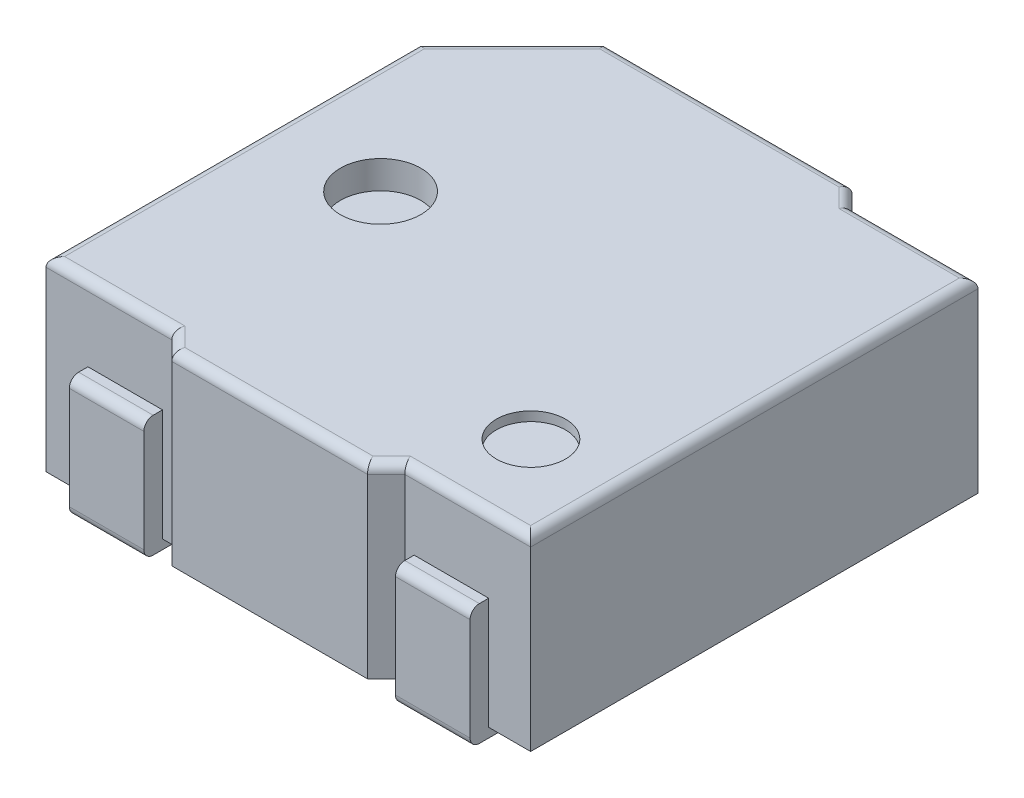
ISO-10303-21;
HEADER;
FILE_DESCRIPTION(('STEP AP214'),'2;1');
FILE_NAME('part.step','',(''),(''),'','','');
FILE_SCHEMA(('AUTOMOTIVE_DESIGN { 1 0 10303 214 1 1 1 1 }'));
ENDSEC;
DATA;
#1=APPLICATION_CONTEXT('core data for automotive mechanical design processes');
#2=APPLICATION_PROTOCOL_DEFINITION('international standard','automotive_design',2000,#1);
#3=PRODUCT_CONTEXT('',#1,'mechanical');
#4=PRODUCT('Part','Part','',(#3));
#5=PRODUCT_RELATED_PRODUCT_CATEGORY('part','',(#4));
#6=PRODUCT_DEFINITION_FORMATION('','',#4);
#7=PRODUCT_DEFINITION_CONTEXT('part definition',#1,'design');
#8=PRODUCT_DEFINITION('design','',#6,#7);
#9=PRODUCT_DEFINITION_SHAPE('','',#8);
#10=(LENGTH_UNIT() NAMED_UNIT(*) SI_UNIT(.MILLI.,.METRE.));
#11=(NAMED_UNIT(*) PLANE_ANGLE_UNIT() SI_UNIT($,.RADIAN.));
#12=(NAMED_UNIT(*) SI_UNIT($,.STERADIAN.) SOLID_ANGLE_UNIT());
#13=UNCERTAINTY_MEASURE_WITH_UNIT(LENGTH_MEASURE(1.E-05),#10,'distance_accuracy_value','');
#14=(GEOMETRIC_REPRESENTATION_CONTEXT(3) GLOBAL_UNCERTAINTY_ASSIGNED_CONTEXT((#13)) GLOBAL_UNIT_ASSIGNED_CONTEXT((#10,
#11,#12)) REPRESENTATION_CONTEXT('',''));
#15=CARTESIAN_POINT('',(0.,0.,0.));
#16=DIRECTION('',(0.,0.,1.));
#17=DIRECTION('',(1.,0.,0.));
#18=AXIS2_PLACEMENT_3D('',#15,#16,#17);
#19=CARTESIAN_POINT('',(-1.410064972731,1.7,0.));
#20=DIRECTION('',(0.,1.,0.));
#21=DIRECTION('',(1.,0.,0.));
#22=AXIS2_PLACEMENT_3D('',#19,#20,#21);
#23=PLANE('',#22);
#24=CARTESIAN_POINT('',(-1.410064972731,1.7,0.));
#25=DIRECTION('',(0.,1.,0.));
#26=DIRECTION('',(0.,0.,1.));
#27=AXIS2_PLACEMENT_3D('',#24,#25,#26);
#28=CIRCLE('',#27,0.432004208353);
#29=CARTESIAN_POINT('',(-1.410064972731,1.7,0.432004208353));
#30=VERTEX_POINT('',#29);
#31=EDGE_CURVE('E2431',#30,#30,#28,.T.);
#32=ORIENTED_EDGE('',*,*,#31,.T.);
#33=EDGE_LOOP('',(#32));
#34=FACE_BOUND('',#33,.T.);
#35=ADVANCED_FACE('F17',(#34),#23,.T.);
#36=CARTESIAN_POINT('',(0.,0.4,1.54222714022));
#37=DIRECTION('',(0.,-1.,0.));
#38=DIRECTION('',(0.,0.,-1.));
#39=AXIS2_PLACEMENT_3D('',#36,#37,#38);
#40=PLANE('',#39);
#41=CARTESIAN_POINT('',(0.,0.4,1.54222714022));
#42=DIRECTION('',(0.,-1.,0.));
#43=DIRECTION('',(0.,0.,-1.));
#44=AXIS2_PLACEMENT_3D('',#41,#42,#43);
#45=CIRCLE('',#44,0.4);
#46=CARTESIAN_POINT('',(0.,0.4,1.14222714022));
#47=VERTEX_POINT('',#46);
#48=EDGE_CURVE('E11',#47,#47,#45,.T.);
#49=ORIENTED_EDGE('',*,*,#48,.T.);
#50=EDGE_LOOP('',(#49));
#51=FACE_BOUND('',#50,.T.);
#52=ADVANCED_FACE('F19',(#51),#40,.T.);
#53=CARTESIAN_POINT('',(0.,0.4,1.54222714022));
#54=DIRECTION('',(0.,-1.,0.));
#55=DIRECTION('',(1.,0.,0.));
#56=AXIS2_PLACEMENT_3D('',#53,#54,#55);
#57=CYLINDRICAL_SURFACE('',#56,0.4);
#58=CARTESIAN_POINT('',(0.,0.,1.54222714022));
#59=DIRECTION('',(0.,-1.,0.));
#60=DIRECTION('',(0.,0.,-1.));
#61=AXIS2_PLACEMENT_3D('',#58,#59,#60);
#62=CIRCLE('',#61,0.4);
#63=CARTESIAN_POINT('',(0.,0.,1.14222714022));
#64=VERTEX_POINT('',#63);
#65=EDGE_CURVE('E339',#64,#64,#62,.T.);
#66=ORIENTED_EDGE('',*,*,#65,.T.);
#67=EDGE_LOOP('',(#66));
#68=FACE_BOUND('',#67,.T.);
#69=ORIENTED_EDGE('',*,*,#48,.F.);
#70=EDGE_LOOP('',(#69));
#71=FACE_BOUND('',#70,.T.);
#72=ADVANCED_FACE('F1644',(#68,#71),#57,.F.);
#73=CARTESIAN_POINT('',(0.,0.4,-1.674903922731));
#74=DIRECTION('',(0.,-1.,0.));
#75=DIRECTION('',(0.,0.,-1.));
#76=AXIS2_PLACEMENT_3D('',#73,#74,#75);
#77=PLANE('',#76);
#78=CARTESIAN_POINT('',(0.,0.4,-1.674903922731));
#79=DIRECTION('',(0.,-1.,0.));
#80=DIRECTION('',(0.,0.,-1.));
#81=AXIS2_PLACEMENT_3D('',#78,#79,#80);
#82=CIRCLE('',#81,0.4);
#83=CARTESIAN_POINT('',(0.,0.4,-2.074903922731));
#84=VERTEX_POINT('',#83);
#85=EDGE_CURVE('E28',#84,#84,#82,.T.);
#86=ORIENTED_EDGE('',*,*,#85,.T.);
#87=EDGE_LOOP('',(#86));
#88=FACE_BOUND('',#87,.T.);
#89=ADVANCED_FACE('F1636',(#88),#77,.T.);
#90=CARTESIAN_POINT('',(0.,0.4,-1.674903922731));
#91=DIRECTION('',(0.,-1.,0.));
#92=DIRECTION('',(1.,0.,0.));
#93=AXIS2_PLACEMENT_3D('',#90,#91,#92);
#94=CYLINDRICAL_SURFACE('',#93,0.4);
#95=CARTESIAN_POINT('',(0.,0.,-1.674903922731));
#96=DIRECTION('',(0.,-1.,0.));
#97=DIRECTION('',(0.,0.,-1.));
#98=AXIS2_PLACEMENT_3D('',#95,#96,#97);
#99=CIRCLE('',#98,0.4);
#100=CARTESIAN_POINT('',(0.,0.,-2.074903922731));
#101=VERTEX_POINT('',#100);
#102=EDGE_CURVE('E334',#101,#101,#99,.T.);
#103=ORIENTED_EDGE('',*,*,#102,.T.);
#104=EDGE_LOOP('',(#103));
#105=FACE_BOUND('',#104,.T.);
#106=ORIENTED_EDGE('',*,*,#85,.F.);
#107=EDGE_LOOP('',(#106));
#108=FACE_BOUND('',#107,.T.);
#109=ADVANCED_FACE('F1186',(#105,#108),#94,.F.);
#110=CARTESIAN_POINT('',(1.35,-0.1,-1.1));
#111=DIRECTION('',(1.,0.,0.));
#112=DIRECTION('',(0.,0.,-1.));
#113=AXIS2_PLACEMENT_3D('',#110,#111,#112);
#114=PLANE('',#113);
#115=DIRECTION('',(0.,1.,0.));
#116=VECTOR('',#115,1.);
#117=CARTESIAN_POINT('',(1.35,-0.1,-2.6));
#118=LINE('',#117,#116);
#119=CARTESIAN_POINT('',(1.35,0.,-2.6));
#120=VERTEX_POINT('',#119);
#121=CARTESIAN_POINT('',(1.35,1.1,-2.6));
#122=VERTEX_POINT('',#121);
#123=EDGE_CURVE('E524',#120,#122,#118,.T.);
#124=ORIENTED_EDGE('',*,*,#123,.F.);
#125=CARTESIAN_POINT('',(1.35,0.,-2.5));
#126=DIRECTION('',(-1.,0.,0.));
#127=DIRECTION('',(0.,0.,-1.));
#128=AXIS2_PLACEMENT_3D('',#125,#126,#127);
#129=CIRCLE('',#128,0.1);
#130=CARTESIAN_POINT('',(1.35,-0.1,-2.5));
#131=VERTEX_POINT('',#130);
#132=EDGE_CURVE('E516',#120,#131,#129,.T.);
#133=ORIENTED_EDGE('',*,*,#132,.T.);
#134=DIRECTION('',(0.,0.,-1.));
#135=VECTOR('',#134,1.);
#136=CARTESIAN_POINT('',(1.35,-0.1,-1.1));
#137=LINE('',#136,#135);
#138=CARTESIAN_POINT('',(1.35,-0.1,-1.1));
#139=VERTEX_POINT('',#138);
#140=EDGE_CURVE('E432',#139,#131,#137,.T.);
#141=ORIENTED_EDGE('',*,*,#140,.F.);
#142=DIRECTION('',(0.,1.,0.));
#143=VECTOR('',#142,1.);
#144=CARTESIAN_POINT('',(1.35,-0.1,-1.1));
#145=LINE('',#144,#143);
#146=CARTESIAN_POINT('',(1.35,0.,-1.1));
#147=VERTEX_POINT('',#146);
#148=EDGE_CURVE('E507',#139,#147,#145,.T.);
#149=ORIENTED_EDGE('',*,*,#148,.T.);
#150=DIRECTION('',(0.,0.,1.));
#151=VECTOR('',#150,1.);
#152=CARTESIAN_POINT('',(1.35,0.,0.));
#153=LINE('',#152,#151);
#154=CARTESIAN_POINT('',(1.35,0.,-2.4));
#155=VERTEX_POINT('',#154);
#156=EDGE_CURVE('E361',#155,#147,#153,.T.);
#157=ORIENTED_EDGE('',*,*,#156,.F.);
#158=DIRECTION('',(0.,1.,0.));
#159=VECTOR('',#158,1.);
#160=CARTESIAN_POINT('',(1.35,0.,-2.4));
#161=LINE('',#160,#159);
#162=CARTESIAN_POINT('',(1.35,1.2,-2.4));
#163=VERTEX_POINT('',#162);
#164=EDGE_CURVE('E281',#155,#163,#161,.T.);
#165=ORIENTED_EDGE('',*,*,#164,.T.);
#166=DIRECTION('',(0.,0.,-1.));
#167=VECTOR('',#166,1.);
#168=CARTESIAN_POINT('',(1.35,1.2,-1.1));
#169=LINE('',#168,#167);
#170=CARTESIAN_POINT('',(1.35,1.2,-2.5));
#171=VERTEX_POINT('',#170);
#172=EDGE_CURVE('E43',#163,#171,#169,.T.);
#173=ORIENTED_EDGE('',*,*,#172,.T.);
#174=CARTESIAN_POINT('',(1.35,1.1,-2.5));
#175=DIRECTION('',(-1.,0.,0.));
#176=DIRECTION('',(0.,0.,-1.));
#177=AXIS2_PLACEMENT_3D('',#174,#175,#176);
#178=CIRCLE('',#177,0.1);
#179=EDGE_CURVE('E532',#171,#122,#178,.T.);
#180=ORIENTED_EDGE('',*,*,#179,.T.);
#181=EDGE_LOOP('',(#124,#133,#141,#149,#157,#165,#173,#180));
#182=FACE_BOUND('',#181,.T.);
#183=ADVANCED_FACE('F1180',(#182),#114,.F.);
#184=CARTESIAN_POINT('',(0.,1.2,0.));
#185=DIRECTION('',(0.,-1.,0.));
#186=DIRECTION('',(0.,0.,-1.));
#187=AXIS2_PLACEMENT_3D('',#184,#185,#186);
#188=PLANE('',#187);
#189=DIRECTION('',(0.,0.,1.));
#190=VECTOR('',#189,1.);
#191=CARTESIAN_POINT('',(2.15,1.2,-1.1));
#192=LINE('',#191,#190);
#193=CARTESIAN_POINT('',(2.15,1.2,-2.5));
#194=VERTEX_POINT('',#193);
#195=CARTESIAN_POINT('',(2.15,1.2,-2.4));
#196=VERTEX_POINT('',#195);
#197=EDGE_CURVE('E499',#194,#196,#192,.T.);
#198=ORIENTED_EDGE('',*,*,#197,.F.);
#199=DIRECTION('',(-1.,0.,0.));
#200=VECTOR('',#199,1.);
#201=CARTESIAN_POINT('',(0.,1.2,-2.5));
#202=LINE('',#201,#200);
#203=EDGE_CURVE('E535',#194,#171,#202,.T.);
#204=ORIENTED_EDGE('',*,*,#203,.T.);
#205=ORIENTED_EDGE('',*,*,#172,.F.);
#206=DIRECTION('',(1.,0.,0.));
#207=VECTOR('',#206,1.);
#208=CARTESIAN_POINT('',(1.25,1.2,-2.4));
#209=LINE('',#208,#207);
#210=EDGE_CURVE('E260',#163,#196,#209,.T.);
#211=ORIENTED_EDGE('',*,*,#210,.T.);
#212=EDGE_LOOP('',(#198,#204,#205,#211));
#213=FACE_BOUND('',#212,.T.);
#214=ADVANCED_FACE('F1185',(#213),#188,.F.);
#215=CARTESIAN_POINT('',(1.35,1.1,-2.5));
#216=DIRECTION('',(1.,0.,0.));
#217=DIRECTION('',(0.,-0.707106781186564,0.707106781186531));
#218=AXIS2_PLACEMENT_3D('',#215,#216,#217);
#219=CYLINDRICAL_SURFACE('',#218,0.1);
#220=ORIENTED_EDGE('',*,*,#179,.F.);
#221=ORIENTED_EDGE('',*,*,#203,.F.);
#222=CARTESIAN_POINT('',(2.15,1.1,-2.5));
#223=DIRECTION('',(1.,0.,0.));
#224=DIRECTION('',(0.,0.,1.));
#225=AXIS2_PLACEMENT_3D('',#222,#223,#224);
#226=CIRCLE('',#225,0.1);
#227=CARTESIAN_POINT('',(2.15,1.1,-2.6));
#228=VERTEX_POINT('',#227);
#229=EDGE_CURVE('E495',#228,#194,#226,.T.);
#230=ORIENTED_EDGE('',*,*,#229,.F.);
#231=DIRECTION('',(1.,0.,0.));
#232=VECTOR('',#231,1.);
#233=CARTESIAN_POINT('',(1.35,1.1,-2.6));
#234=LINE('',#233,#232);
#235=EDGE_CURVE('E528',#122,#228,#234,.T.);
#236=ORIENTED_EDGE('',*,*,#235,.F.);
#237=EDGE_LOOP('',(#220,#221,#230,#236));
#238=FACE_BOUND('',#237,.T.);
#239=ADVANCED_FACE('F1607',(#238),#219,.T.);
#240=CARTESIAN_POINT('',(1.35,-0.1,-2.6));
#241=DIRECTION('',(0.,0.,1.));
#242=DIRECTION('',(1.,0.,0.));
#243=AXIS2_PLACEMENT_3D('',#240,#241,#242);
#244=PLANE('',#243);
#245=DIRECTION('',(0.,1.,0.));
#246=VECTOR('',#245,1.);
#247=CARTESIAN_POINT('',(2.15,-0.1,-2.6));
#248=LINE('',#247,#246);
#249=CARTESIAN_POINT('',(2.15,0.,-2.6));
#250=VERTEX_POINT('',#249);
#251=EDGE_CURVE('E322',#250,#228,#248,.T.);
#252=ORIENTED_EDGE('',*,*,#251,.F.);
#253=DIRECTION('',(-1.,0.,0.));
#254=VECTOR('',#253,1.);
#255=CARTESIAN_POINT('',(1.35,0.,-2.6));
#256=LINE('',#255,#254);
#257=EDGE_CURVE('E520',#250,#120,#256,.T.);
#258=ORIENTED_EDGE('',*,*,#257,.T.);
#259=ORIENTED_EDGE('',*,*,#123,.T.);
#260=ORIENTED_EDGE('',*,*,#235,.T.);
#261=EDGE_LOOP('',(#252,#258,#259,#260));
#262=FACE_BOUND('',#261,.T.);
#263=ADVANCED_FACE('F1151',(#262),#244,.F.);
#264=CARTESIAN_POINT('',(0.,0.,-2.5));
#265=DIRECTION('',(-1.,0.,0.));
#266=DIRECTION('',(0.,0.707106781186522,0.707106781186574));
#267=AXIS2_PLACEMENT_3D('',#264,#265,#266);
#268=CYLINDRICAL_SURFACE('',#267,0.1);
#269=ORIENTED_EDGE('',*,*,#132,.F.);
#270=ORIENTED_EDGE('',*,*,#257,.F.);
#271=CARTESIAN_POINT('',(2.15,0.,-2.5));
#272=DIRECTION('',(1.,0.,0.));
#273=DIRECTION('',(0.,0.,1.));
#274=AXIS2_PLACEMENT_3D('',#271,#272,#273);
#275=CIRCLE('',#274,0.1);
#276=CARTESIAN_POINT('',(2.15,-0.1,-2.5));
#277=VERTEX_POINT('',#276);
#278=EDGE_CURVE('E318',#277,#250,#275,.T.);
#279=ORIENTED_EDGE('',*,*,#278,.F.);
#280=DIRECTION('',(1.,0.,0.));
#281=VECTOR('',#280,1.);
#282=CARTESIAN_POINT('',(2.15,-0.1,-2.5));
#283=LINE('',#282,#281);
#284=EDGE_CURVE('E436',#131,#277,#283,.T.);
#285=ORIENTED_EDGE('',*,*,#284,.F.);
#286=EDGE_LOOP('',(#269,#270,#279,#285));
#287=FACE_BOUND('',#286,.T.);
#288=ADVANCED_FACE('F1145',(#287),#268,.T.);
#289=CARTESIAN_POINT('',(0.,-0.1,0.));
#290=DIRECTION('',(0.,-1.,0.));
#291=DIRECTION('',(0.,0.,-1.));
#292=AXIS2_PLACEMENT_3D('',#289,#290,#291);
#293=PLANE('',#292);
#294=ORIENTED_EDGE('',*,*,#140,.T.);
#295=ORIENTED_EDGE('',*,*,#284,.T.);
#296=DIRECTION('',(0.,0.,1.));
#297=VECTOR('',#296,1.);
#298=CARTESIAN_POINT('',(2.15,-0.1,-1.1));
#299=LINE('',#298,#297);
#300=CARTESIAN_POINT('',(2.15,-0.1,-1.1));
#301=VERTEX_POINT('',#300);
#302=EDGE_CURVE('E323',#277,#301,#299,.T.);
#303=ORIENTED_EDGE('',*,*,#302,.T.);
#304=DIRECTION('',(-1.,0.,0.));
#305=VECTOR('',#304,1.);
#306=CARTESIAN_POINT('',(1.35,-0.1,-1.1));
#307=LINE('',#306,#305);
#308=EDGE_CURVE('E437',#301,#139,#307,.T.);
#309=ORIENTED_EDGE('',*,*,#308,.T.);
#310=EDGE_LOOP('',(#294,#295,#303,#309));
#311=FACE_BOUND('',#310,.T.);
#312=ADVANCED_FACE('F1150',(#311),#293,.T.);
#313=CARTESIAN_POINT('',(1.35,-0.1,-1.1));
#314=DIRECTION('',(0.,0.,-1.));
#315=DIRECTION('',(-1.,0.,0.));
#316=AXIS2_PLACEMENT_3D('',#313,#314,#315);
#317=PLANE('',#316);
#318=DIRECTION('',(1.,0.,0.));
#319=VECTOR('',#318,1.);
#320=CARTESIAN_POINT('',(0.,0.,-1.1));
#321=LINE('',#320,#319);
#322=CARTESIAN_POINT('',(2.15,0.,-1.1));
#323=VERTEX_POINT('',#322);
#324=EDGE_CURVE('E374',#147,#323,#321,.T.);
#325=ORIENTED_EDGE('',*,*,#324,.F.);
#326=ORIENTED_EDGE('',*,*,#148,.F.);
#327=ORIENTED_EDGE('',*,*,#308,.F.);
#328=DIRECTION('',(0.,1.,0.));
#329=VECTOR('',#328,1.);
#330=CARTESIAN_POINT('',(2.15,-0.1,-1.1));
#331=LINE('',#330,#329);
#332=EDGE_CURVE('E503',#301,#323,#331,.T.);
#333=ORIENTED_EDGE('',*,*,#332,.T.);
#334=EDGE_LOOP('',(#325,#326,#327,#333));
#335=FACE_BOUND('',#334,.T.);
#336=ADVANCED_FACE('F1578',(#335),#317,.F.);
#337=CARTESIAN_POINT('',(2.15,-0.1,-1.1));
#338=DIRECTION('',(-1.,0.,0.));
#339=DIRECTION('',(0.,0.,1.));
#340=AXIS2_PLACEMENT_3D('',#337,#338,#339);
#341=PLANE('',#340);
#342=ORIENTED_EDGE('',*,*,#302,.F.);
#343=ORIENTED_EDGE('',*,*,#278,.T.);
#344=ORIENTED_EDGE('',*,*,#251,.T.);
#345=ORIENTED_EDGE('',*,*,#229,.T.);
#346=ORIENTED_EDGE('',*,*,#197,.T.);
#347=DIRECTION('',(0.,-1.,0.));
#348=VECTOR('',#347,1.);
#349=CARTESIAN_POINT('',(2.15,0.,-2.4));
#350=LINE('',#349,#348);
#351=CARTESIAN_POINT('',(2.15,0.,-2.4));
#352=VERTEX_POINT('',#351);
#353=EDGE_CURVE('E256',#196,#352,#350,.T.);
#354=ORIENTED_EDGE('',*,*,#353,.T.);
#355=DIRECTION('',(0.,0.,-1.));
#356=VECTOR('',#355,1.);
#357=CARTESIAN_POINT('',(2.15,0.,0.));
#358=LINE('',#357,#356);
#359=EDGE_CURVE('E378',#323,#352,#358,.T.);
#360=ORIENTED_EDGE('',*,*,#359,.F.);
#361=ORIENTED_EDGE('',*,*,#332,.F.);
#362=EDGE_LOOP('',(#342,#343,#344,#345,#346,#354,#360,#361));
#363=FACE_BOUND('',#362,.T.);
#364=ADVANCED_FACE('F1568',(#363),#341,.F.);
#365=CARTESIAN_POINT('',(-1.25,1.9,2.3));
#366=DIRECTION('',(-1.,0.,0.));
#367=DIRECTION('',(0.,-0.707106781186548,-0.707106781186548));
#368=AXIS2_PLACEMENT_3D('',#365,#366,#367);
#369=CYLINDRICAL_SURFACE('',#368,0.1);
#370=CARTESIAN_POINT('',(-2.5,1.9,2.3));
#371=DIRECTION('',(0.707106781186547,0.,0.707106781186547));
#372=DIRECTION('',(-0.707106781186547,0.,0.707106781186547));
#373=AXIS2_PLACEMENT_3D('',#370,#371,#372);
#374=ELLIPSE('',#373,0.14142135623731,0.1);
#375=CARTESIAN_POINT('',(-2.6,1.9,2.4));
#376=VERTEX_POINT('',#375);
#377=CARTESIAN_POINT('',(-2.5,2.,2.3));
#378=VERTEX_POINT('',#377);
#379=EDGE_CURVE('E172',#376,#378,#374,.F.);
#380=ORIENTED_EDGE('',*,*,#379,.F.);
#381=DIRECTION('',(-1.,0.,0.));
#382=VECTOR('',#381,1.);
#383=CARTESIAN_POINT('',(-1.25,1.9,2.4));
#384=LINE('',#383,#382);
#385=CARTESIAN_POINT('',(-1.24999999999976,1.9,2.40000000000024));
#386=VERTEX_POINT('',#385);
#387=EDGE_CURVE('E169',#386,#376,#384,.T.);
#388=ORIENTED_EDGE('',*,*,#387,.F.);
#389=CARTESIAN_POINT('',(-1.208578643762,1.9,2.3));
#390=DIRECTION('',(-0.923879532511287,0.,-0.38268343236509));
#391=DIRECTION('',(-0.382683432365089,0.,0.923879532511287));
#392=AXIS2_PLACEMENT_3D('',#389,#390,#391);
#393=ELLIPSE('',#392,0.108239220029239,0.1);
#394=CARTESIAN_POINT('',(-1.208578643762,2.,2.3));
#395=VERTEX_POINT('',#394);
#396=EDGE_CURVE('E21',#395,#386,#393,.F.);
#397=ORIENTED_EDGE('',*,*,#396,.F.);
#398=DIRECTION('',(1.,0.,0.));
#399=VECTOR('',#398,1.);
#400=CARTESIAN_POINT('',(0.,2.,2.3));
#401=LINE('',#400,#399);
#402=EDGE_CURVE('E547',#378,#395,#401,.T.);
#403=ORIENTED_EDGE('',*,*,#402,.F.);
#404=EDGE_LOOP('',(#380,#388,#397,#403));
#405=FACE_BOUND('',#404,.T.);
#406=ADVANCED_FACE('F171',(#405),#369,.T.);
#407=CARTESIAN_POINT('',(-2.5,1.9,0.));
#408=DIRECTION('',(0.,0.,1.));
#409=DIRECTION('',(0.707106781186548,-0.707106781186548,0.));
#410=AXIS2_PLACEMENT_3D('',#407,#408,#409);
#411=CYLINDRICAL_SURFACE('',#410,0.1);
#412=ORIENTED_EDGE('',*,*,#379,.T.);
#413=DIRECTION('',(0.,0.,1.));
#414=VECTOR('',#413,1.);
#415=CARTESIAN_POINT('',(-2.5,2.,0.));
#416=LINE('',#415,#414);
#417=CARTESIAN_POINT('',(-2.5,2.,-1.558578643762));
#418=VERTEX_POINT('',#417);
#419=EDGE_CURVE('E550',#418,#378,#416,.T.);
#420=ORIENTED_EDGE('',*,*,#419,.F.);
#421=CARTESIAN_POINT('',(-2.5,1.9,-1.558578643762));
#422=DIRECTION('',(-0.38268343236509,0.,0.923879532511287));
#423=DIRECTION('',(-0.923879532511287,0.,-0.382683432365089));
#424=AXIS2_PLACEMENT_3D('',#421,#422,#423);
#425=ELLIPSE('',#424,0.108239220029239,0.1);
#426=CARTESIAN_POINT('',(-2.60000000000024,1.9,-1.59999999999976));
#427=VERTEX_POINT('',#426);
#428=EDGE_CURVE('E652',#427,#418,#425,.F.);
#429=ORIENTED_EDGE('',*,*,#428,.F.);
#430=DIRECTION('',(0.,0.,-1.));
#431=VECTOR('',#430,1.);
#432=CARTESIAN_POINT('',(-2.6,1.9,2.6));
#433=LINE('',#432,#431);
#434=EDGE_CURVE('E266',#376,#427,#433,.T.);
#435=ORIENTED_EDGE('',*,*,#434,.F.);
#436=EDGE_LOOP('',(#412,#420,#429,#435));
#437=FACE_BOUND('',#436,.T.);
#438=ADVANCED_FACE('F686',(#437),#411,.T.);
#439=CARTESIAN_POINT('',(-2.029289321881,1.9,-2.029289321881));
#440=DIRECTION('',(-0.707106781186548,0.,0.707106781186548));
#441=DIRECTION('',(0.5,-0.707106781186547,0.5));
#442=AXIS2_PLACEMENT_3D('',#439,#440,#441);
#443=CYLINDRICAL_SURFACE('',#442,0.1);
#444=ORIENTED_EDGE('',*,*,#428,.T.);
#445=DIRECTION('',(-0.707106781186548,0.,0.707106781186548));
#446=VECTOR('',#445,1.);
#447=CARTESIAN_POINT('',(-2.029289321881,2.,-2.029289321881));
#448=LINE('',#447,#446);
#449=CARTESIAN_POINT('',(-1.558578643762,2.,-2.5));
#450=VERTEX_POINT('',#449);
#451=EDGE_CURVE('E554',#450,#418,#448,.T.);
#452=ORIENTED_EDGE('',*,*,#451,.F.);
#453=CARTESIAN_POINT('',(-1.558578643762,1.9,-2.5));
#454=DIRECTION('',(-0.923879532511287,0.,0.38268343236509));
#455=DIRECTION('',(-0.382683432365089,0.,-0.923879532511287));
#456=AXIS2_PLACEMENT_3D('',#453,#454,#455);
#457=ELLIPSE('',#456,0.108239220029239,0.1);
#458=CARTESIAN_POINT('',(-1.59999999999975,1.9,-2.60000000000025));
#459=VERTEX_POINT('',#458);
#460=EDGE_CURVE('E655',#459,#450,#457,.F.);
#461=ORIENTED_EDGE('',*,*,#460,.F.);
#462=DIRECTION('',(0.707106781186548,0.,-0.707106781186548));
#463=VECTOR('',#462,1.);
#464=CARTESIAN_POINT('',(-2.6,1.9,-1.6));
#465=LINE('',#464,#463);
#466=EDGE_CURVE('E555',#427,#459,#465,.T.);
#467=ORIENTED_EDGE('',*,*,#466,.F.);
#468=EDGE_LOOP('',(#444,#452,#461,#467));
#469=FACE_BOUND('',#468,.T.);
#470=ADVANCED_FACE('F1538',(#469),#443,.T.);
#471=CARTESIAN_POINT('',(0.,1.9,-2.5));
#472=DIRECTION('',(-1.,0.,0.));
#473=DIRECTION('',(0.,-0.707106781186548,0.707106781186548));
#474=AXIS2_PLACEMENT_3D('',#471,#472,#473);
#475=CYLINDRICAL_SURFACE('',#474,0.1);
#476=ORIENTED_EDGE('',*,*,#460,.T.);
#477=DIRECTION('',(-1.,0.,0.));
#478=VECTOR('',#477,1.);
#479=CARTESIAN_POINT('',(0.,2.,-2.5));
#480=LINE('',#479,#478);
#481=CARTESIAN_POINT('',(1.008578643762,2.,-2.5));
#482=VERTEX_POINT('',#481);
#483=EDGE_CURVE('E566',#482,#450,#480,.T.);
#484=ORIENTED_EDGE('',*,*,#483,.F.);
#485=CARTESIAN_POINT('',(1.008578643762,1.9,-2.5));
#486=DIRECTION('',(0.923879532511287,0.,0.38268343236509));
#487=DIRECTION('',(-0.382683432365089,0.,0.923879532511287));
#488=AXIS2_PLACEMENT_3D('',#485,#486,#487);
#489=ELLIPSE('',#488,0.108239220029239,0.1);
#490=CARTESIAN_POINT('',(1.04999999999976,1.9,-2.60000000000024));
#491=VERTEX_POINT('',#490);
#492=EDGE_CURVE('E582',#491,#482,#489,.T.);
#493=ORIENTED_EDGE('',*,*,#492,.F.);
#494=DIRECTION('',(1.,0.,0.));
#495=VECTOR('',#494,1.);
#496=CARTESIAN_POINT('',(-1.6,1.9,-2.6));
#497=LINE('',#496,#495);
#498=EDGE_CURVE('E567',#459,#491,#497,.T.);
#499=ORIENTED_EDGE('',*,*,#498,.F.);
#500=EDGE_LOOP('',(#476,#484,#493,#499));
#501=FACE_BOUND('',#500,.T.);
#502=ADVANCED_FACE('F1527',(#501),#475,.T.);
#503=CARTESIAN_POINT('',(0.979289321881,1.9,-2.529289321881));
#504=DIRECTION('',(0.707106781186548,0.,0.707106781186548));
#505=DIRECTION('',(-0.5,-0.707106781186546,0.5));
#506=AXIS2_PLACEMENT_3D('',#503,#504,#505);
#507=CYLINDRICAL_SURFACE('',#506,0.1);
#508=ORIENTED_EDGE('',*,*,#492,.T.);
#509=DIRECTION('',(-0.707106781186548,0.,-0.707106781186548));
#510=VECTOR('',#509,1.);
#511=CARTESIAN_POINT('',(1.754289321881,2.,-1.754289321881));
#512=LINE('',#511,#510);
#513=CARTESIAN_POINT('',(1.208578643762,2.,-2.3));
#514=VERTEX_POINT('',#513);
#515=EDGE_CURVE('E578',#514,#482,#512,.T.);
#516=ORIENTED_EDGE('',*,*,#515,.F.);
#517=CARTESIAN_POINT('',(1.208578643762,1.9,-2.3));
#518=DIRECTION('',(0.923879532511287,0.,0.38268343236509));
#519=DIRECTION('',(-0.382683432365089,0.,0.923879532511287));
#520=AXIS2_PLACEMENT_3D('',#517,#518,#519);
#521=ELLIPSE('',#520,0.108239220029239,0.1);
#522=CARTESIAN_POINT('',(1.24999999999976,1.9,-2.40000000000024));
#523=VERTEX_POINT('',#522);
#524=EDGE_CURVE('E598',#523,#514,#521,.T.);
#525=ORIENTED_EDGE('',*,*,#524,.F.);
#526=DIRECTION('',(0.707106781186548,0.,0.707106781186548));
#527=VECTOR('',#526,1.);
#528=CARTESIAN_POINT('',(1.05,1.9,-2.6));
#529=LINE('',#528,#527);
#530=EDGE_CURVE('E579',#491,#523,#529,.T.);
#531=ORIENTED_EDGE('',*,*,#530,.F.);
#532=EDGE_LOOP('',(#508,#516,#525,#531));
#533=FACE_BOUND('',#532,.T.);
#534=ADVANCED_FACE('F1516',(#533),#507,.T.);
#535=CARTESIAN_POINT('',(1.05,0.,-2.6));
#536=DIRECTION('',(-0.707106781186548,0.,0.707106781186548));
#537=DIRECTION('',(0.,1.,0.));
#538=AXIS2_PLACEMENT_3D('',#535,#536,#537);
#539=PLANE('',#538);
#540=DIRECTION('',(0.,1.,0.));
#541=VECTOR('',#540,1.);
#542=CARTESIAN_POINT('',(1.05,0.,-2.6));
#543=LINE('',#542,#541);
#544=CARTESIAN_POINT('',(1.05,0.,-2.6));
#545=VERTEX_POINT('',#544);
#546=EDGE_CURVE('E571',#545,#491,#543,.T.);
#547=ORIENTED_EDGE('',*,*,#546,.T.);
#548=ORIENTED_EDGE('',*,*,#530,.T.);
#549=DIRECTION('',(0.,1.,0.));
#550=VECTOR('',#549,1.);
#551=CARTESIAN_POINT('',(1.25,0.,-2.4));
#552=LINE('',#551,#550);
#553=CARTESIAN_POINT('',(1.25,0.,-2.4));
#554=VERTEX_POINT('',#553);
#555=EDGE_CURVE('E590',#554,#523,#552,.T.);
#556=ORIENTED_EDGE('',*,*,#555,.F.);
#557=DIRECTION('',(0.707106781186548,0.,0.707106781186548));
#558=VECTOR('',#557,1.);
#559=CARTESIAN_POINT('',(1.05,0.,-2.6));
#560=LINE('',#559,#558);
#561=EDGE_CURVE('E356',#545,#554,#560,.T.);
#562=ORIENTED_EDGE('',*,*,#561,.F.);
#563=EDGE_LOOP('',(#547,#548,#556,#562));
#564=FACE_BOUND('',#563,.T.);
#565=ADVANCED_FACE('F1505',(#564),#539,.F.);
#566=CARTESIAN_POINT('',(-1.6,2.,-2.6));
#567=DIRECTION('',(0.,0.,1.));
#568=DIRECTION('',(1.,0.,0.));
#569=AXIS2_PLACEMENT_3D('',#566,#567,#568);
#570=PLANE('',#569);
#571=DIRECTION('',(0.,-1.,0.));
#572=VECTOR('',#571,1.);
#573=CARTESIAN_POINT('',(-1.6,2.,-2.6));
#574=LINE('',#573,#572);
#575=CARTESIAN_POINT('',(-1.6,0.,-2.6));
#576=VERTEX_POINT('',#575);
#577=EDGE_CURVE('E559',#459,#576,#574,.T.);
#578=ORIENTED_EDGE('',*,*,#577,.F.);
#579=ORIENTED_EDGE('',*,*,#498,.T.);
#580=ORIENTED_EDGE('',*,*,#546,.F.);
#581=DIRECTION('',(-1.,0.,0.));
#582=VECTOR('',#581,1.);
#583=CARTESIAN_POINT('',(-1.6,0.,-2.6));
#584=LINE('',#583,#582);
#585=EDGE_CURVE('E352',#545,#576,#584,.T.);
#586=ORIENTED_EDGE('',*,*,#585,.T.);
#587=EDGE_LOOP('',(#578,#579,#580,#586));
#588=FACE_BOUND('',#587,.T.);
#589=ADVANCED_FACE('F1494',(#588),#570,.F.);
#590=CARTESIAN_POINT('',(-2.6,2.,-1.6));
#591=DIRECTION('',(0.707106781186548,0.,0.707106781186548));
#592=DIRECTION('',(0.,-1.,0.));
#593=AXIS2_PLACEMENT_3D('',#590,#591,#592);
#594=PLANE('',#593);
#595=DIRECTION('',(0.,-1.,0.));
#596=VECTOR('',#595,1.);
#597=CARTESIAN_POINT('',(-2.6,2.,-1.6));
#598=LINE('',#597,#596);
#599=CARTESIAN_POINT('',(-2.6,0.,-1.6));
#600=VERTEX_POINT('',#599);
#601=EDGE_CURVE('E543',#427,#600,#598,.T.);
#602=ORIENTED_EDGE('',*,*,#601,.F.);
#603=ORIENTED_EDGE('',*,*,#466,.T.);
#604=ORIENTED_EDGE('',*,*,#577,.T.);
#605=DIRECTION('',(-0.707106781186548,0.,0.707106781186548));
#606=VECTOR('',#605,1.);
#607=CARTESIAN_POINT('',(-2.6,0.,-1.6));
#608=LINE('',#607,#606);
#609=EDGE_CURVE('E357',#576,#600,#608,.T.);
#610=ORIENTED_EDGE('',*,*,#609,.T.);
#611=EDGE_LOOP('',(#602,#603,#604,#610));
#612=FACE_BOUND('',#611,.T.);
#613=ADVANCED_FACE('F1484',(#612),#594,.F.);
#614=CARTESIAN_POINT('',(-2.6,2.,2.6));
#615=DIRECTION('',(1.,0.,0.));
#616=DIRECTION('',(0.,1.,0.));
#617=AXIS2_PLACEMENT_3D('',#614,#615,#616);
#618=PLANE('',#617);
#619=DIRECTION('',(0.,1.,0.));
#620=VECTOR('',#619,1.);
#621=CARTESIAN_POINT('',(-2.6,0.,2.4));
#622=LINE('',#621,#620);
#623=CARTESIAN_POINT('',(-2.6,0.,2.4));
#624=VERTEX_POINT('',#623);
#625=EDGE_CURVE('E177',#624,#376,#622,.T.);
#626=ORIENTED_EDGE('',*,*,#625,.T.);
#627=ORIENTED_EDGE('',*,*,#434,.T.);
#628=ORIENTED_EDGE('',*,*,#601,.T.);
#629=DIRECTION('',(0.,0.,1.));
#630=VECTOR('',#629,1.);
#631=CARTESIAN_POINT('',(-2.6,0.,2.6));
#632=LINE('',#631,#630);
#633=EDGE_CURVE('E236',#600,#624,#632,.T.);
#634=ORIENTED_EDGE('',*,*,#633,.T.);
#635=EDGE_LOOP('',(#626,#627,#628,#634));
#636=FACE_BOUND('',#635,.T.);
#637=ADVANCED_FACE('F690',(#636),#618,.F.);
#638=CARTESIAN_POINT('',(0.,1.2,0.));
#639=DIRECTION('',(0.,1.,0.));
#640=DIRECTION('',(1.,0.,0.));
#641=AXIS2_PLACEMENT_3D('',#638,#639,#640);
#642=PLANE('',#641);
#643=DIRECTION('',(0.,0.,-1.));
#644=VECTOR('',#643,1.);
#645=CARTESIAN_POINT('',(-2.15,1.2,1.1));
#646=LINE('',#645,#644);
#647=CARTESIAN_POINT('',(-2.15,1.2,2.5));
#648=VERTEX_POINT('',#647);
#649=CARTESIAN_POINT('',(-2.15,1.2,2.4));
#650=VERTEX_POINT('',#649);
#651=EDGE_CURVE('E479',#648,#650,#646,.T.);
#652=ORIENTED_EDGE('',*,*,#651,.F.);
#653=DIRECTION('',(1.,0.,0.));
#654=VECTOR('',#653,1.);
#655=CARTESIAN_POINT('',(-1.35,1.2,2.5));
#656=LINE('',#655,#654);
#657=CARTESIAN_POINT('',(-1.35,1.2,2.5));
#658=VERTEX_POINT('',#657);
#659=EDGE_CURVE('E262',#648,#658,#656,.T.);
#660=ORIENTED_EDGE('',*,*,#659,.T.);
#661=DIRECTION('',(0.,0.,1.));
#662=VECTOR('',#661,1.);
#663=CARTESIAN_POINT('',(-1.35,1.2,1.1));
#664=LINE('',#663,#662);
#665=CARTESIAN_POINT('',(-1.35,1.2,2.4));
#666=VERTEX_POINT('',#665);
#667=EDGE_CURVE('E467',#666,#658,#664,.T.);
#668=ORIENTED_EDGE('',*,*,#667,.F.);
#669=DIRECTION('',(1.,0.,0.));
#670=VECTOR('',#669,1.);
#671=CARTESIAN_POINT('',(-1.25,1.2,2.4));
#672=LINE('',#671,#670);
#673=EDGE_CURVE('E459',#650,#666,#672,.T.);
#674=ORIENTED_EDGE('',*,*,#673,.F.);
#675=EDGE_LOOP('',(#652,#660,#668,#674));
#676=FACE_BOUND('',#675,.T.);
#677=ADVANCED_FACE('F874',(#676),#642,.T.);
#678=CARTESIAN_POINT('',(-1.35,1.1,2.5));
#679=DIRECTION('',(1.,0.,0.));
#680=DIRECTION('',(0.,-0.707106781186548,-0.707106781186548));
#681=AXIS2_PLACEMENT_3D('',#678,#679,#680);
#682=CYLINDRICAL_SURFACE('',#681,0.1);
#683=CARTESIAN_POINT('',(-1.35,1.1,2.5));
#684=DIRECTION('',(1.,0.,0.));
#685=DIRECTION('',(0.,0.,1.));
#686=AXIS2_PLACEMENT_3D('',#683,#684,#685);
#687=CIRCLE('',#686,0.1);
#688=CARTESIAN_POINT('',(-1.35,1.1,2.6));
#689=VERTEX_POINT('',#688);
#690=EDGE_CURVE('E468',#658,#689,#687,.T.);
#691=ORIENTED_EDGE('',*,*,#690,.F.);
#692=ORIENTED_EDGE('',*,*,#659,.F.);
#693=CARTESIAN_POINT('',(-2.15,1.1,2.5));
#694=DIRECTION('',(-1.,0.,0.));
#695=DIRECTION('',(0.,0.,-1.));
#696=AXIS2_PLACEMENT_3D('',#693,#694,#695);
#697=CIRCLE('',#696,0.1);
#698=CARTESIAN_POINT('',(-2.15,1.1,2.6));
#699=VERTEX_POINT('',#698);
#700=EDGE_CURVE('E285',#699,#648,#697,.T.);
#701=ORIENTED_EDGE('',*,*,#700,.F.);
#702=DIRECTION('',(-1.,0.,0.));
#703=VECTOR('',#702,1.);
#704=CARTESIAN_POINT('',(-2.15,1.1,2.6));
#705=LINE('',#704,#703);
#706=EDGE_CURVE('E267',#689,#699,#705,.T.);
#707=ORIENTED_EDGE('',*,*,#706,.F.);
#708=EDGE_LOOP('',(#691,#692,#701,#707));
#709=FACE_BOUND('',#708,.T.);
#710=ADVANCED_FACE('F870',(#709),#682,.T.);
#711=CARTESIAN_POINT('',(-1.35,-0.1,2.6));
#712=DIRECTION('',(0.,0.,-1.));
#713=DIRECTION('',(0.,-1.,0.));
#714=AXIS2_PLACEMENT_3D('',#711,#712,#713);
#715=PLANE('',#714);
#716=DIRECTION('',(0.,1.,0.));
#717=VECTOR('',#716,1.);
#718=CARTESIAN_POINT('',(-1.35,-0.1,2.6));
#719=LINE('',#718,#717);
#720=CARTESIAN_POINT('',(-1.35,0.,2.6));
#721=VERTEX_POINT('',#720);
#722=EDGE_CURVE('E472',#721,#689,#719,.T.);
#723=ORIENTED_EDGE('',*,*,#722,.T.);
#724=ORIENTED_EDGE('',*,*,#706,.T.);
#725=DIRECTION('',(0.,1.,0.));
#726=VECTOR('',#725,1.);
#727=CARTESIAN_POINT('',(-2.15,-0.1,2.6));
#728=LINE('',#727,#726);
#729=CARTESIAN_POINT('',(-2.15,0.,2.6));
#730=VERTEX_POINT('',#729);
#731=EDGE_CURVE('E242',#730,#699,#728,.T.);
#732=ORIENTED_EDGE('',*,*,#731,.F.);
#733=DIRECTION('',(1.,0.,0.));
#734=VECTOR('',#733,1.);
#735=CARTESIAN_POINT('',(-1.35,0.,2.6));
#736=LINE('',#735,#734);
#737=EDGE_CURVE('E430',#730,#721,#736,.T.);
#738=ORIENTED_EDGE('',*,*,#737,.T.);
#739=EDGE_LOOP('',(#723,#724,#732,#738));
#740=FACE_BOUND('',#739,.T.);
#741=ADVANCED_FACE('F879',(#740),#715,.F.);
#742=CARTESIAN_POINT('',(0.,-0.1,0.));
#743=DIRECTION('',(0.,1.,0.));
#744=DIRECTION('',(1.,0.,0.));
#745=AXIS2_PLACEMENT_3D('',#742,#743,#744);
#746=PLANE('',#745);
#747=DIRECTION('',(0.,0.,1.));
#748=VECTOR('',#747,1.);
#749=CARTESIAN_POINT('',(-1.35,-0.1,1.1));
#750=LINE('',#749,#748);
#751=CARTESIAN_POINT('',(-1.35,-0.1,1.1));
#752=VERTEX_POINT('',#751);
#753=CARTESIAN_POINT('',(-1.35,-0.1,2.5));
#754=VERTEX_POINT('',#753);
#755=EDGE_CURVE('E250',#752,#754,#750,.T.);
#756=ORIENTED_EDGE('',*,*,#755,.T.);
#757=DIRECTION('',(-1.,0.,0.));
#758=VECTOR('',#757,1.);
#759=CARTESIAN_POINT('',(0.,-0.1,2.5));
#760=LINE('',#759,#758);
#761=CARTESIAN_POINT('',(-2.15,-0.1,2.5));
#762=VERTEX_POINT('',#761);
#763=EDGE_CURVE('E370',#754,#762,#760,.T.);
#764=ORIENTED_EDGE('',*,*,#763,.T.);
#765=DIRECTION('',(0.,0.,-1.));
#766=VECTOR('',#765,1.);
#767=CARTESIAN_POINT('',(-2.15,-0.1,1.1));
#768=LINE('',#767,#766);
#769=CARTESIAN_POINT('',(-2.15,-0.1,1.1));
#770=VERTEX_POINT('',#769);
#771=EDGE_CURVE('E431',#762,#770,#768,.T.);
#772=ORIENTED_EDGE('',*,*,#771,.T.);
#773=DIRECTION('',(1.,0.,0.));
#774=VECTOR('',#773,1.);
#775=CARTESIAN_POINT('',(-1.35,-0.1,1.1));
#776=LINE('',#775,#774);
#777=EDGE_CURVE('E243',#770,#752,#776,.T.);
#778=ORIENTED_EDGE('',*,*,#777,.T.);
#779=EDGE_LOOP('',(#756,#764,#772,#778));
#780=FACE_BOUND('',#779,.T.);
#781=ADVANCED_FACE('F919',(#780),#746,.F.);
#782=CARTESIAN_POINT('',(0.,0.,2.5));
#783=DIRECTION('',(-1.,0.,0.));
#784=DIRECTION('',(0.,0.707106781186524,-0.707106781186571));
#785=AXIS2_PLACEMENT_3D('',#782,#783,#784);
#786=CYLINDRICAL_SURFACE('',#785,0.1);
#787=CARTESIAN_POINT('',(-1.35,0.,2.5));
#788=DIRECTION('',(1.,0.,0.));
#789=DIRECTION('',(0.,0.,1.));
#790=AXIS2_PLACEMENT_3D('',#787,#788,#789);
#791=CIRCLE('',#790,0.1);
#792=EDGE_CURVE('E255',#721,#754,#791,.T.);
#793=ORIENTED_EDGE('',*,*,#792,.F.);
#794=ORIENTED_EDGE('',*,*,#737,.F.);
#795=CARTESIAN_POINT('',(-2.15,0.,2.5));
#796=DIRECTION('',(-1.,0.,0.));
#797=DIRECTION('',(0.,0.,-1.));
#798=AXIS2_PLACEMENT_3D('',#795,#796,#797);
#799=CIRCLE('',#798,0.1);
#800=EDGE_CURVE('E426',#762,#730,#799,.T.);
#801=ORIENTED_EDGE('',*,*,#800,.F.);
#802=ORIENTED_EDGE('',*,*,#763,.F.);
#803=EDGE_LOOP('',(#793,#794,#801,#802));
#804=FACE_BOUND('',#803,.T.);
#805=ADVANCED_FACE('F882',(#804),#786,.T.);
#806=CARTESIAN_POINT('',(-2.15,-0.1,1.1));
#807=DIRECTION('',(1.,0.,0.));
#808=DIRECTION('',(0.,0.,1.));
#809=AXIS2_PLACEMENT_3D('',#806,#807,#808);
#810=PLANE('',#809);
#811=ORIENTED_EDGE('',*,*,#731,.T.);
#812=ORIENTED_EDGE('',*,*,#700,.T.);
#813=ORIENTED_EDGE('',*,*,#651,.T.);
#814=DIRECTION('',(0.,-1.,0.));
#815=VECTOR('',#814,1.);
#816=CARTESIAN_POINT('',(-2.15,0.,2.4));
#817=LINE('',#816,#815);
#818=CARTESIAN_POINT('',(-2.15,0.,2.4));
#819=VERTEX_POINT('',#818);
#820=EDGE_CURVE('E455',#650,#819,#817,.T.);
#821=ORIENTED_EDGE('',*,*,#820,.T.);
#822=DIRECTION('',(0.,0.,1.));
#823=VECTOR('',#822,1.);
#824=CARTESIAN_POINT('',(-2.15,0.,0.));
#825=LINE('',#824,#823);
#826=CARTESIAN_POINT('',(-2.15,0.,1.1));
#827=VERTEX_POINT('',#826);
#828=EDGE_CURVE('E237',#827,#819,#825,.T.);
#829=ORIENTED_EDGE('',*,*,#828,.F.);
#830=DIRECTION('',(0.,1.,0.));
#831=VECTOR('',#830,1.);
#832=CARTESIAN_POINT('',(-2.15,-0.1,1.1));
#833=LINE('',#832,#831);
#834=EDGE_CURVE('E238',#770,#827,#833,.T.);
#835=ORIENTED_EDGE('',*,*,#834,.F.);
#836=ORIENTED_EDGE('',*,*,#771,.F.);
#837=ORIENTED_EDGE('',*,*,#800,.T.);
#838=EDGE_LOOP('',(#811,#812,#813,#821,#829,#835,#836,#837));
#839=FACE_BOUND('',#838,.T.);
#840=ADVANCED_FACE('F877',(#839),#810,.F.);
#841=CARTESIAN_POINT('',(-1.35,-0.1,1.1));
#842=DIRECTION('',(0.,0.,1.));
#843=DIRECTION('',(1.,0.,0.));
#844=AXIS2_PLACEMENT_3D('',#841,#842,#843);
#845=PLANE('',#844);
#846=DIRECTION('',(-1.,0.,0.));
#847=VECTOR('',#846,1.);
#848=CARTESIAN_POINT('',(0.,0.,1.1));
#849=LINE('',#848,#847);
#850=CARTESIAN_POINT('',(-1.35,0.,1.1));
#851=VERTEX_POINT('',#850);
#852=EDGE_CURVE('E345',#851,#827,#849,.T.);
#853=ORIENTED_EDGE('',*,*,#852,.F.);
#854=DIRECTION('',(0.,1.,0.));
#855=VECTOR('',#854,1.);
#856=CARTESIAN_POINT('',(-1.35,-0.1,1.1));
#857=LINE('',#856,#855);
#858=EDGE_CURVE('E254',#752,#851,#857,.T.);
#859=ORIENTED_EDGE('',*,*,#858,.F.);
#860=ORIENTED_EDGE('',*,*,#777,.F.);
#861=ORIENTED_EDGE('',*,*,#834,.T.);
#862=EDGE_LOOP('',(#853,#859,#860,#861));
#863=FACE_BOUND('',#862,.T.);
#864=ADVANCED_FACE('F917',(#863),#845,.F.);
#865=CARTESIAN_POINT('',(-1.35,-0.1,1.1));
#866=DIRECTION('',(-1.,0.,0.));
#867=DIRECTION('',(0.,0.,1.));
#868=AXIS2_PLACEMENT_3D('',#865,#866,#867);
#869=PLANE('',#868);
#870=ORIENTED_EDGE('',*,*,#667,.T.);
#871=ORIENTED_EDGE('',*,*,#690,.T.);
#872=ORIENTED_EDGE('',*,*,#722,.F.);
#873=ORIENTED_EDGE('',*,*,#792,.T.);
#874=ORIENTED_EDGE('',*,*,#755,.F.);
#875=ORIENTED_EDGE('',*,*,#858,.T.);
#876=DIRECTION('',(0.,0.,-1.));
#877=VECTOR('',#876,1.);
#878=CARTESIAN_POINT('',(-1.35,0.,0.));
#879=LINE('',#878,#877);
#880=CARTESIAN_POINT('',(-1.35,0.,2.4));
#881=VERTEX_POINT('',#880);
#882=EDGE_CURVE('E313',#881,#851,#879,.T.);
#883=ORIENTED_EDGE('',*,*,#882,.F.);
#884=DIRECTION('',(0.,1.,0.));
#885=VECTOR('',#884,1.);
#886=CARTESIAN_POINT('',(-1.35,0.,2.4));
#887=LINE('',#886,#885);
#888=EDGE_CURVE('E463',#881,#666,#887,.T.);
#889=ORIENTED_EDGE('',*,*,#888,.T.);
#890=EDGE_LOOP('',(#870,#871,#872,#873,#874,#875,#883,#889));
#891=FACE_BOUND('',#890,.T.);
#892=ADVANCED_FACE('F885',(#891),#869,.F.);
#893=CARTESIAN_POINT('',(-1.25,0.,2.4));
#894=DIRECTION('',(0.,0.,-1.));
#895=DIRECTION('',(0.,-1.,0.));
#896=AXIS2_PLACEMENT_3D('',#893,#894,#895);
#897=PLANE('',#896);
#898=DIRECTION('',(0.,1.,0.));
#899=VECTOR('',#898,1.);
#900=CARTESIAN_POINT('',(-1.25,0.,2.4));
#901=LINE('',#900,#899);
#902=CARTESIAN_POINT('',(-1.25,0.,2.4));
#903=VERTEX_POINT('',#902);
#904=EDGE_CURVE('E178',#903,#386,#901,.T.);
#905=ORIENTED_EDGE('',*,*,#904,.T.);
#906=ORIENTED_EDGE('',*,*,#387,.T.);
#907=ORIENTED_EDGE('',*,*,#625,.F.);
#908=DIRECTION('',(-1.,0.,0.));
#909=VECTOR('',#908,1.);
#910=CARTESIAN_POINT('',(-1.25,0.,2.4));
#911=LINE('',#910,#909);
#912=EDGE_CURVE('E232',#819,#624,#911,.T.);
#913=ORIENTED_EDGE('',*,*,#912,.F.);
#914=ORIENTED_EDGE('',*,*,#820,.F.);
#915=ORIENTED_EDGE('',*,*,#673,.T.);
#916=ORIENTED_EDGE('',*,*,#888,.F.);
#917=DIRECTION('',(-1.,0.,0.));
#918=VECTOR('',#917,1.);
#919=CARTESIAN_POINT('',(-1.25,0.,2.4));
#920=LINE('',#919,#918);
#921=EDGE_CURVE('E187',#903,#881,#920,.T.);
#922=ORIENTED_EDGE('',*,*,#921,.F.);
#923=EDGE_LOOP('',(#905,#906,#907,#913,#914,#915,#916,#922));
#924=FACE_BOUND('',#923,.T.);
#925=ADVANCED_FACE('F183',(#924),#897,.F.);
#926=CARTESIAN_POINT('',(-1.05,0.,2.6));
#927=DIRECTION('',(0.707106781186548,0.,-0.707106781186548));
#928=DIRECTION('',(0.,-1.,0.));
#929=AXIS2_PLACEMENT_3D('',#926,#927,#928);
#930=PLANE('',#929);
#931=DIRECTION('',(0.,1.,0.));
#932=VECTOR('',#931,1.);
#933=CARTESIAN_POINT('',(-1.05,0.,2.6));
#934=LINE('',#933,#932);
#935=CARTESIAN_POINT('',(-1.05,0.,2.6));
#936=VERTEX_POINT('',#935);
#937=CARTESIAN_POINT('',(-1.04999999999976,1.9,2.60000000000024));
#938=VERTEX_POINT('',#937);
#939=EDGE_CURVE('E192',#936,#938,#934,.T.);
#940=ORIENTED_EDGE('',*,*,#939,.T.);
#941=DIRECTION('',(-0.707106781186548,0.,-0.707106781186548));
#942=VECTOR('',#941,1.);
#943=CARTESIAN_POINT('',(-1.05,1.9,2.6));
#944=LINE('',#943,#942);
#945=EDGE_CURVE('E195',#938,#386,#944,.T.);
#946=ORIENTED_EDGE('',*,*,#945,.T.);
#947=ORIENTED_EDGE('',*,*,#904,.F.);
#948=DIRECTION('',(-0.707106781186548,0.,-0.707106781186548));
#949=VECTOR('',#948,1.);
#950=CARTESIAN_POINT('',(-1.05,0.,2.6));
#951=LINE('',#950,#949);
#952=EDGE_CURVE('E314',#936,#903,#951,.T.);
#953=ORIENTED_EDGE('',*,*,#952,.F.);
#954=EDGE_LOOP('',(#940,#946,#947,#953));
#955=FACE_BOUND('',#954,.T.);
#956=ADVANCED_FACE('F196',(#955),#930,.F.);
#957=CARTESIAN_POINT('',(2.6,2.,2.6));
#958=DIRECTION('',(0.,0.,-1.));
#959=DIRECTION('',(0.,-1.,0.));
#960=AXIS2_PLACEMENT_3D('',#957,#958,#959);
#961=PLANE('',#960);
#962=DIRECTION('',(0.,1.,0.));
#963=VECTOR('',#962,1.);
#964=CARTESIAN_POINT('',(1.05,0.,2.6));
#965=LINE('',#964,#963);
#966=CARTESIAN_POINT('',(1.05,0.,2.6));
#967=VERTEX_POINT('',#966);
#968=CARTESIAN_POINT('',(1.04999999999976,1.9,2.60000000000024));
#969=VERTEX_POINT('',#968);
#970=EDGE_CURVE('E454',#967,#969,#965,.T.);
#971=ORIENTED_EDGE('',*,*,#970,.T.);
#972=DIRECTION('',(-1.,0.,0.));
#973=VECTOR('',#972,1.);
#974=CARTESIAN_POINT('',(2.6,1.9,2.6));
#975=LINE('',#974,#973);
#976=EDGE_CURVE('E643',#969,#938,#975,.T.);
#977=ORIENTED_EDGE('',*,*,#976,.T.);
#978=ORIENTED_EDGE('',*,*,#939,.F.);
#979=DIRECTION('',(1.,0.,0.));
#980=VECTOR('',#979,1.);
#981=CARTESIAN_POINT('',(2.6,0.,2.6));
#982=LINE('',#981,#980);
#983=EDGE_CURVE('E330',#936,#967,#982,.T.);
#984=ORIENTED_EDGE('',*,*,#983,.T.);
#985=EDGE_LOOP('',(#971,#977,#978,#984));
#986=FACE_BOUND('',#985,.T.);
#987=ADVANCED_FACE('F1404',(#986),#961,.F.);
#988=CARTESIAN_POINT('',(1.05,0.,2.6));
#989=DIRECTION('',(-0.707106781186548,0.,-0.707106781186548));
#990=DIRECTION('',(-0.707106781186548,0.,0.707106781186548));
#991=AXIS2_PLACEMENT_3D('',#988,#989,#990);
#992=PLANE('',#991);
#993=DIRECTION('',(0.,1.,0.));
#994=VECTOR('',#993,1.);
#995=CARTESIAN_POINT('',(1.25,0.,2.4));
#996=LINE('',#995,#994);
#997=CARTESIAN_POINT('',(1.25,0.,2.4));
#998=VERTEX_POINT('',#997);
#999=CARTESIAN_POINT('',(1.24999999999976,1.9,2.40000000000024));
#1000=VERTEX_POINT('',#999);
#1001=EDGE_CURVE('E395',#998,#1000,#996,.T.);
#1002=ORIENTED_EDGE('',*,*,#1001,.T.);
#1003=DIRECTION('',(-0.707106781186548,0.,0.707106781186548));
#1004=VECTOR('',#1003,1.);
#1005=CARTESIAN_POINT('',(1.05,1.9,2.6));
#1006=LINE('',#1005,#1004);
#1007=EDGE_CURVE('E632',#1000,#969,#1006,.T.);
#1008=ORIENTED_EDGE('',*,*,#1007,.T.);
#1009=ORIENTED_EDGE('',*,*,#970,.F.);
#1010=DIRECTION('',(-0.707106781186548,0.,0.707106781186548));
#1011=VECTOR('',#1010,1.);
#1012=CARTESIAN_POINT('',(1.05,0.,2.6));
#1013=LINE('',#1012,#1011);
#1014=EDGE_CURVE('E248',#998,#967,#1013,.T.);
#1015=ORIENTED_EDGE('',*,*,#1014,.F.);
#1016=EDGE_LOOP('',(#1002,#1008,#1009,#1015));
#1017=FACE_BOUND('',#1016,.T.);
#1018=ADVANCED_FACE('F1393',(#1017),#992,.F.);
#1019=CARTESIAN_POINT('',(0.,1.2,0.));
#1020=DIRECTION('',(0.,-1.,0.));
#1021=DIRECTION('',(0.,0.,-1.));
#1022=AXIS2_PLACEMENT_3D('',#1019,#1020,#1021);
#1023=PLANE('',#1022);
#1024=DIRECTION('',(0.,0.,-1.));
#1025=VECTOR('',#1024,1.);
#1026=CARTESIAN_POINT('',(1.35,1.2,1.1));
#1027=LINE('',#1026,#1025);
#1028=CARTESIAN_POINT('',(1.35,1.2,2.5));
#1029=VERTEX_POINT('',#1028);
#1030=CARTESIAN_POINT('',(1.35,1.2,2.4));
#1031=VERTEX_POINT('',#1030);
#1032=EDGE_CURVE('E366',#1029,#1031,#1027,.T.);
#1033=ORIENTED_EDGE('',*,*,#1032,.F.);
#1034=DIRECTION('',(1.,0.,0.));
#1035=VECTOR('',#1034,1.);
#1036=CARTESIAN_POINT('',(0.,1.2,2.5));
#1037=LINE('',#1036,#1035);
#1038=CARTESIAN_POINT('',(2.15,1.2,2.5));
#1039=VERTEX_POINT('',#1038);
#1040=EDGE_CURVE('E272',#1029,#1039,#1037,.T.);
#1041=ORIENTED_EDGE('',*,*,#1040,.T.);
#1042=DIRECTION('',(0.,0.,1.));
#1043=VECTOR('',#1042,1.);
#1044=CARTESIAN_POINT('',(2.15,1.2,1.1));
#1045=LINE('',#1044,#1043);
#1046=CARTESIAN_POINT('',(2.15,1.2,2.4));
#1047=VERTEX_POINT('',#1046);
#1048=EDGE_CURVE('E399',#1047,#1039,#1045,.T.);
#1049=ORIENTED_EDGE('',*,*,#1048,.F.);
#1050=DIRECTION('',(-1.,0.,0.));
#1051=VECTOR('',#1050,1.);
#1052=CARTESIAN_POINT('',(1.25,1.2,2.4));
#1053=LINE('',#1052,#1051);
#1054=EDGE_CURVE('E289',#1047,#1031,#1053,.T.);
#1055=ORIENTED_EDGE('',*,*,#1054,.T.);
#1056=EDGE_LOOP('',(#1033,#1041,#1049,#1055));
#1057=FACE_BOUND('',#1056,.T.);
#1058=ADVANCED_FACE('F1382',(#1057),#1023,.F.);
#1059=CARTESIAN_POINT('',(1.35,1.1,2.5));
#1060=DIRECTION('',(-1.,0.,0.));
#1061=DIRECTION('',(0.,-0.707106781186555,-0.70710678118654));
#1062=AXIS2_PLACEMENT_3D('',#1059,#1060,#1061);
#1063=CYLINDRICAL_SURFACE('',#1062,0.1);
#1064=CARTESIAN_POINT('',(2.15,1.1,2.5));
#1065=DIRECTION('',(1.,0.,0.));
#1066=DIRECTION('',(0.,0.,1.));
#1067=AXIS2_PLACEMENT_3D('',#1064,#1065,#1066);
#1068=CIRCLE('',#1067,0.1);
#1069=CARTESIAN_POINT('',(2.15,1.1,2.6));
#1070=VERTEX_POINT('',#1069);
#1071=EDGE_CURVE('E403',#1039,#1070,#1068,.T.);
#1072=ORIENTED_EDGE('',*,*,#1071,.F.);
#1073=ORIENTED_EDGE('',*,*,#1040,.F.);
#1074=CARTESIAN_POINT('',(1.35,1.1,2.5));
#1075=DIRECTION('',(-1.,0.,0.));
#1076=DIRECTION('',(0.,0.,-1.));
#1077=AXIS2_PLACEMENT_3D('',#1074,#1075,#1076);
#1078=CIRCLE('',#1077,0.1);
#1079=CARTESIAN_POINT('',(1.35,1.1,2.6));
#1080=VERTEX_POINT('',#1079);
#1081=EDGE_CURVE('E362',#1080,#1029,#1078,.T.);
#1082=ORIENTED_EDGE('',*,*,#1081,.F.);
#1083=DIRECTION('',(-1.,0.,0.));
#1084=VECTOR('',#1083,1.);
#1085=CARTESIAN_POINT('',(1.35,1.1,2.6));
#1086=LINE('',#1085,#1084);
#1087=EDGE_CURVE('E268',#1070,#1080,#1086,.T.);
#1088=ORIENTED_EDGE('',*,*,#1087,.F.);
#1089=EDGE_LOOP('',(#1072,#1073,#1082,#1088));
#1090=FACE_BOUND('',#1089,.T.);
#1091=ADVANCED_FACE('F1371',(#1090),#1063,.T.);
#1092=CARTESIAN_POINT('',(1.35,-0.1,2.6));
#1093=DIRECTION('',(0.,0.,-1.));
#1094=DIRECTION('',(-1.,0.,0.));
#1095=AXIS2_PLACEMENT_3D('',#1092,#1093,#1094);
#1096=PLANE('',#1095);
#1097=DIRECTION('',(0.,1.,0.));
#1098=VECTOR('',#1097,1.);
#1099=CARTESIAN_POINT('',(2.15,-0.1,2.6));
#1100=LINE('',#1099,#1098);
#1101=CARTESIAN_POINT('',(2.15,0.,2.6));
#1102=VERTEX_POINT('',#1101);
#1103=EDGE_CURVE('E404',#1102,#1070,#1100,.T.);
#1104=ORIENTED_EDGE('',*,*,#1103,.T.);
#1105=ORIENTED_EDGE('',*,*,#1087,.T.);
#1106=DIRECTION('',(0.,1.,0.));
#1107=VECTOR('',#1106,1.);
#1108=CARTESIAN_POINT('',(1.35,-0.1,2.6));
#1109=LINE('',#1108,#1107);
#1110=CARTESIAN_POINT('',(1.35,0.,2.6));
#1111=VERTEX_POINT('',#1110);
#1112=EDGE_CURVE('E301',#1111,#1080,#1109,.T.);
#1113=ORIENTED_EDGE('',*,*,#1112,.F.);
#1114=DIRECTION('',(1.,0.,0.));
#1115=VECTOR('',#1114,1.);
#1116=CARTESIAN_POINT('',(2.15,0.,2.6));
#1117=LINE('',#1116,#1115);
#1118=EDGE_CURVE('E441',#1111,#1102,#1117,.T.);
#1119=ORIENTED_EDGE('',*,*,#1118,.T.);
#1120=EDGE_LOOP('',(#1104,#1105,#1113,#1119));
#1121=FACE_BOUND('',#1120,.T.);
#1122=ADVANCED_FACE('F1360',(#1121),#1096,.F.);
#1123=CARTESIAN_POINT('',(0.,-0.1,0.));
#1124=DIRECTION('',(0.,-1.,0.));
#1125=DIRECTION('',(0.,0.,-1.));
#1126=AXIS2_PLACEMENT_3D('',#1123,#1124,#1125);
#1127=PLANE('',#1126);
#1128=DIRECTION('',(0.,0.,1.));
#1129=VECTOR('',#1128,1.);
#1130=CARTESIAN_POINT('',(2.15,-0.1,1.1));
#1131=LINE('',#1130,#1129);
#1132=CARTESIAN_POINT('',(2.15,-0.1,1.1));
#1133=VERTEX_POINT('',#1132);
#1134=CARTESIAN_POINT('',(2.15,-0.1,2.5));
#1135=VERTEX_POINT('',#1134);
#1136=EDGE_CURVE('E412',#1133,#1135,#1131,.T.);
#1137=ORIENTED_EDGE('',*,*,#1136,.T.);
#1138=DIRECTION('',(-1.,0.,0.));
#1139=VECTOR('',#1138,1.);
#1140=CARTESIAN_POINT('',(1.35,-0.1,2.5));
#1141=LINE('',#1140,#1139);
#1142=CARTESIAN_POINT('',(1.35,-0.1,2.5));
#1143=VERTEX_POINT('',#1142);
#1144=EDGE_CURVE('E273',#1135,#1143,#1141,.T.);
#1145=ORIENTED_EDGE('',*,*,#1144,.T.);
#1146=DIRECTION('',(0.,0.,-1.));
#1147=VECTOR('',#1146,1.);
#1148=CARTESIAN_POINT('',(1.35,-0.1,1.1));
#1149=LINE('',#1148,#1147);
#1150=CARTESIAN_POINT('',(1.35,-0.1,1.1));
#1151=VERTEX_POINT('',#1150);
#1152=EDGE_CURVE('E391',#1143,#1151,#1149,.T.);
#1153=ORIENTED_EDGE('',*,*,#1152,.T.);
#1154=DIRECTION('',(1.,0.,0.));
#1155=VECTOR('',#1154,1.);
#1156=CARTESIAN_POINT('',(1.35,-0.1,1.1));
#1157=LINE('',#1156,#1155);
#1158=EDGE_CURVE('E226',#1151,#1133,#1157,.T.);
#1159=ORIENTED_EDGE('',*,*,#1158,.T.);
#1160=EDGE_LOOP('',(#1137,#1145,#1153,#1159));
#1161=FACE_BOUND('',#1160,.T.);
#1162=ADVANCED_FACE('F1349',(#1161),#1127,.T.);
#1163=CARTESIAN_POINT('',(0.,0.,2.5));
#1164=DIRECTION('',(1.,0.,0.));
#1165=DIRECTION('',(0.,0.707106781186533,-0.707106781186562));
#1166=AXIS2_PLACEMENT_3D('',#1163,#1164,#1165);
#1167=CYLINDRICAL_SURFACE('',#1166,0.1);
#1168=CARTESIAN_POINT('',(2.15,0.,2.5));
#1169=DIRECTION('',(1.,0.,0.));
#1170=DIRECTION('',(0.,0.,1.));
#1171=AXIS2_PLACEMENT_3D('',#1168,#1169,#1170);
#1172=CIRCLE('',#1171,0.1);
#1173=EDGE_CURVE('E408',#1102,#1135,#1172,.T.);
#1174=ORIENTED_EDGE('',*,*,#1173,.F.);
#1175=ORIENTED_EDGE('',*,*,#1118,.F.);
#1176=CARTESIAN_POINT('',(1.35,0.,2.5));
#1177=DIRECTION('',(-1.,0.,0.));
#1178=DIRECTION('',(0.,0.,-1.));
#1179=AXIS2_PLACEMENT_3D('',#1176,#1177,#1178);
#1180=CIRCLE('',#1179,0.1);
#1181=EDGE_CURVE('E425',#1143,#1111,#1180,.T.);
#1182=ORIENTED_EDGE('',*,*,#1181,.F.);
#1183=ORIENTED_EDGE('',*,*,#1144,.F.);
#1184=EDGE_LOOP('',(#1174,#1175,#1182,#1183));
#1185=FACE_BOUND('',#1184,.T.);
#1186=ADVANCED_FACE('F1338',(#1185),#1167,.T.);
#1187=CARTESIAN_POINT('',(1.35,-0.1,1.1));
#1188=DIRECTION('',(1.,0.,0.));
#1189=DIRECTION('',(0.,0.,1.));
#1190=AXIS2_PLACEMENT_3D('',#1187,#1188,#1189);
#1191=PLANE('',#1190);
#1192=ORIENTED_EDGE('',*,*,#1112,.T.);
#1193=ORIENTED_EDGE('',*,*,#1081,.T.);
#1194=ORIENTED_EDGE('',*,*,#1032,.T.);
#1195=DIRECTION('',(0.,-1.,0.));
#1196=VECTOR('',#1195,1.);
#1197=CARTESIAN_POINT('',(1.35,0.,2.4));
#1198=LINE('',#1197,#1196);
#1199=CARTESIAN_POINT('',(1.35,0.,2.4));
#1200=VERTEX_POINT('',#1199);
#1201=EDGE_CURVE('E294',#1031,#1200,#1198,.T.);
#1202=ORIENTED_EDGE('',*,*,#1201,.T.);
#1203=DIRECTION('',(0.,0.,1.));
#1204=VECTOR('',#1203,1.);
#1205=CARTESIAN_POINT('',(1.35,0.,0.));
#1206=LINE('',#1205,#1204);
#1207=CARTESIAN_POINT('',(1.35,0.,1.1));
#1208=VERTEX_POINT('',#1207);
#1209=EDGE_CURVE('E249',#1208,#1200,#1206,.T.);
#1210=ORIENTED_EDGE('',*,*,#1209,.F.);
#1211=DIRECTION('',(0.,1.,0.));
#1212=VECTOR('',#1211,1.);
#1213=CARTESIAN_POINT('',(1.35,-0.1,1.1));
#1214=LINE('',#1213,#1212);
#1215=EDGE_CURVE('E230',#1151,#1208,#1214,.T.);
#1216=ORIENTED_EDGE('',*,*,#1215,.F.);
#1217=ORIENTED_EDGE('',*,*,#1152,.F.);
#1218=ORIENTED_EDGE('',*,*,#1181,.T.);
#1219=EDGE_LOOP('',(#1192,#1193,#1194,#1202,#1210,#1216,#1217,#1218));
#1220=FACE_BOUND('',#1219,.T.);
#1221=ADVANCED_FACE('F1327',(#1220),#1191,.F.);
#1222=CARTESIAN_POINT('',(1.35,-0.1,1.1));
#1223=DIRECTION('',(0.,0.,1.));
#1224=DIRECTION('',(1.,0.,0.));
#1225=AXIS2_PLACEMENT_3D('',#1222,#1223,#1224);
#1226=PLANE('',#1225);
#1227=DIRECTION('',(-1.,0.,0.));
#1228=VECTOR('',#1227,1.);
#1229=CARTESIAN_POINT('',(0.,0.,1.1));
#1230=LINE('',#1229,#1228);
#1231=CARTESIAN_POINT('',(2.15,0.,1.1));
#1232=VERTEX_POINT('',#1231);
#1233=EDGE_CURVE('E310',#1232,#1208,#1230,.T.);
#1234=ORIENTED_EDGE('',*,*,#1233,.F.);
#1235=DIRECTION('',(0.,1.,0.));
#1236=VECTOR('',#1235,1.);
#1237=CARTESIAN_POINT('',(2.15,-0.1,1.1));
#1238=LINE('',#1237,#1236);
#1239=EDGE_CURVE('E231',#1133,#1232,#1238,.T.);
#1240=ORIENTED_EDGE('',*,*,#1239,.F.);
#1241=ORIENTED_EDGE('',*,*,#1158,.F.);
#1242=ORIENTED_EDGE('',*,*,#1215,.T.);
#1243=EDGE_LOOP('',(#1234,#1240,#1241,#1242));
#1244=FACE_BOUND('',#1243,.T.);
#1245=ADVANCED_FACE('F1316',(#1244),#1226,.F.);
#1246=CARTESIAN_POINT('',(2.15,-0.1,1.1));
#1247=DIRECTION('',(-1.,0.,0.));
#1248=DIRECTION('',(0.,0.,1.));
#1249=AXIS2_PLACEMENT_3D('',#1246,#1247,#1248);
#1250=PLANE('',#1249);
#1251=ORIENTED_EDGE('',*,*,#1048,.T.);
#1252=ORIENTED_EDGE('',*,*,#1071,.T.);
#1253=ORIENTED_EDGE('',*,*,#1103,.F.);
#1254=ORIENTED_EDGE('',*,*,#1173,.T.);
#1255=ORIENTED_EDGE('',*,*,#1136,.F.);
#1256=ORIENTED_EDGE('',*,*,#1239,.T.);
#1257=DIRECTION('',(0.,0.,-1.));
#1258=VECTOR('',#1257,1.);
#1259=CARTESIAN_POINT('',(2.15,0.,0.));
#1260=LINE('',#1259,#1258);
#1261=CARTESIAN_POINT('',(2.15,0.,2.4));
#1262=VERTEX_POINT('',#1261);
#1263=EDGE_CURVE('E306',#1262,#1232,#1260,.T.);
#1264=ORIENTED_EDGE('',*,*,#1263,.F.);
#1265=DIRECTION('',(0.,1.,0.));
#1266=VECTOR('',#1265,1.);
#1267=CARTESIAN_POINT('',(2.15,0.,2.4));
#1268=LINE('',#1267,#1266);
#1269=EDGE_CURVE('E293',#1262,#1047,#1268,.T.);
#1270=ORIENTED_EDGE('',*,*,#1269,.T.);
#1271=EDGE_LOOP('',(#1251,#1252,#1253,#1254,#1255,#1256,#1264,#1270));
#1272=FACE_BOUND('',#1271,.T.);
#1273=ADVANCED_FACE('F1136',(#1272),#1250,.F.);
#1274=CARTESIAN_POINT('',(1.25,0.,2.4));
#1275=DIRECTION('',(0.,0.,-1.));
#1276=DIRECTION('',(0.,-1.,0.));
#1277=AXIS2_PLACEMENT_3D('',#1274,#1275,#1276);
#1278=PLANE('',#1277);
#1279=DIRECTION('',(0.,1.,0.));
#1280=VECTOR('',#1279,1.);
#1281=CARTESIAN_POINT('',(2.6,0.,2.4));
#1282=LINE('',#1281,#1280);
#1283=CARTESIAN_POINT('',(2.6,0.,2.4));
#1284=VERTEX_POINT('',#1283);
#1285=CARTESIAN_POINT('',(2.6,1.9,2.4));
#1286=VERTEX_POINT('',#1285);
#1287=EDGE_CURVE('E338',#1284,#1286,#1282,.T.);
#1288=ORIENTED_EDGE('',*,*,#1287,.T.);
#1289=DIRECTION('',(-1.,0.,0.));
#1290=VECTOR('',#1289,1.);
#1291=CARTESIAN_POINT('',(1.25,1.9,2.4));
#1292=LINE('',#1291,#1290);
#1293=EDGE_CURVE('E621',#1286,#1000,#1292,.T.);
#1294=ORIENTED_EDGE('',*,*,#1293,.T.);
#1295=ORIENTED_EDGE('',*,*,#1001,.F.);
#1296=DIRECTION('',(-1.,0.,0.));
#1297=VECTOR('',#1296,1.);
#1298=CARTESIAN_POINT('',(1.25,0.,2.4));
#1299=LINE('',#1298,#1297);
#1300=EDGE_CURVE('E244',#1200,#998,#1299,.T.);
#1301=ORIENTED_EDGE('',*,*,#1300,.F.);
#1302=ORIENTED_EDGE('',*,*,#1201,.F.);
#1303=ORIENTED_EDGE('',*,*,#1054,.F.);
#1304=ORIENTED_EDGE('',*,*,#1269,.F.);
#1305=DIRECTION('',(-1.,0.,0.));
#1306=VECTOR('',#1305,1.);
#1307=CARTESIAN_POINT('',(1.25,0.,2.4));
#1308=LINE('',#1307,#1306);
#1309=EDGE_CURVE('E305',#1284,#1262,#1308,.T.);
#1310=ORIENTED_EDGE('',*,*,#1309,.F.);
#1311=EDGE_LOOP('',(#1288,#1294,#1295,#1301,#1302,#1303,#1304,#1310));
#1312=FACE_BOUND('',#1311,.T.);
#1313=ADVANCED_FACE('F1130',(#1312),#1278,.F.);
#1314=CARTESIAN_POINT('',(2.6,2.,-2.6));
#1315=DIRECTION('',(-1.,0.,0.));
#1316=DIRECTION('',(0.,1.,0.));
#1317=AXIS2_PLACEMENT_3D('',#1314,#1315,#1316);
#1318=PLANE('',#1317);
#1319=DIRECTION('',(0.,1.,0.));
#1320=VECTOR('',#1319,1.);
#1321=CARTESIAN_POINT('',(2.6,0.,-2.4));
#1322=LINE('',#1321,#1320);
#1323=CARTESIAN_POINT('',(2.6,0.,-2.4));
#1324=VERTEX_POINT('',#1323);
#1325=CARTESIAN_POINT('',(2.6,1.9,-2.4));
#1326=VERTEX_POINT('',#1325);
#1327=EDGE_CURVE('E277',#1324,#1326,#1322,.T.);
#1328=ORIENTED_EDGE('',*,*,#1327,.T.);
#1329=DIRECTION('',(0.,0.,1.));
#1330=VECTOR('',#1329,1.);
#1331=CARTESIAN_POINT('',(2.6,1.9,-2.6));
#1332=LINE('',#1331,#1330);
#1333=EDGE_CURVE('E609',#1326,#1286,#1332,.T.);
#1334=ORIENTED_EDGE('',*,*,#1333,.T.);
#1335=ORIENTED_EDGE('',*,*,#1287,.F.);
#1336=DIRECTION('',(0.,0.,-1.));
#1337=VECTOR('',#1336,1.);
#1338=CARTESIAN_POINT('',(2.6,0.,-2.6));
#1339=LINE('',#1338,#1337);
#1340=EDGE_CURVE('E382',#1284,#1324,#1339,.T.);
#1341=ORIENTED_EDGE('',*,*,#1340,.T.);
#1342=EDGE_LOOP('',(#1328,#1334,#1335,#1341));
#1343=FACE_BOUND('',#1342,.T.);
#1344=ADVANCED_FACE('F1135',(#1343),#1318,.F.);
#1345=CARTESIAN_POINT('',(0.,0.,0.));
#1346=DIRECTION('',(0.,-1.,0.));
#1347=DIRECTION('',(0.,0.,-1.));
#1348=AXIS2_PLACEMENT_3D('',#1345,#1346,#1347);
#1349=PLANE('',#1348);
#1350=ORIENTED_EDGE('',*,*,#102,.F.);
#1351=EDGE_LOOP('',(#1350));
#1352=FACE_BOUND('',#1351,.T.);
#1353=ORIENTED_EDGE('',*,*,#65,.F.);
#1354=EDGE_LOOP('',(#1353));
#1355=FACE_BOUND('',#1354,.T.);
#1356=ORIENTED_EDGE('',*,*,#1309,.T.);
#1357=ORIENTED_EDGE('',*,*,#1263,.T.);
#1358=ORIENTED_EDGE('',*,*,#1233,.T.);
#1359=ORIENTED_EDGE('',*,*,#1209,.T.);
#1360=ORIENTED_EDGE('',*,*,#1300,.T.);
#1361=ORIENTED_EDGE('',*,*,#1014,.T.);
#1362=ORIENTED_EDGE('',*,*,#983,.F.);
#1363=ORIENTED_EDGE('',*,*,#952,.T.);
#1364=ORIENTED_EDGE('',*,*,#921,.T.);
#1365=ORIENTED_EDGE('',*,*,#882,.T.);
#1366=ORIENTED_EDGE('',*,*,#852,.T.);
#1367=ORIENTED_EDGE('',*,*,#828,.T.);
#1368=ORIENTED_EDGE('',*,*,#912,.T.);
#1369=ORIENTED_EDGE('',*,*,#633,.F.);
#1370=ORIENTED_EDGE('',*,*,#609,.F.);
#1371=ORIENTED_EDGE('',*,*,#585,.F.);
#1372=ORIENTED_EDGE('',*,*,#561,.T.);
#1373=DIRECTION('',(1.,0.,0.));
#1374=VECTOR('',#1373,1.);
#1375=CARTESIAN_POINT('',(1.25,0.,-2.4));
#1376=LINE('',#1375,#1374);
#1377=EDGE_CURVE('E297',#554,#155,#1376,.T.);
#1378=ORIENTED_EDGE('',*,*,#1377,.T.);
#1379=ORIENTED_EDGE('',*,*,#156,.T.);
#1380=ORIENTED_EDGE('',*,*,#324,.T.);
#1381=ORIENTED_EDGE('',*,*,#359,.T.);
#1382=DIRECTION('',(1.,0.,0.));
#1383=VECTOR('',#1382,1.);
#1384=CARTESIAN_POINT('',(1.25,0.,-2.4));
#1385=LINE('',#1384,#1383);
#1386=EDGE_CURVE('E261',#352,#1324,#1385,.T.);
#1387=ORIENTED_EDGE('',*,*,#1386,.T.);
#1388=ORIENTED_EDGE('',*,*,#1340,.F.);
#1389=EDGE_LOOP('',(#1356,#1357,#1358,#1359,#1360,#1361,#1362,#1363,#1364,#1365,#1366,#1367,
#1368,#1369,#1370,#1371,#1372,#1378,#1379,#1380,#1381,#1387,#1388));
#1390=FACE_BOUND('',#1389,.T.);
#1391=ADVANCED_FACE('F914',(#1352,#1355,#1390),#1349,.T.);
#1392=CARTESIAN_POINT('',(1.25,0.,-2.4));
#1393=DIRECTION('',(0.,0.,1.));
#1394=DIRECTION('',(1.,0.,0.));
#1395=AXIS2_PLACEMENT_3D('',#1392,#1393,#1394);
#1396=PLANE('',#1395);
#1397=ORIENTED_EDGE('',*,*,#555,.T.);
#1398=DIRECTION('',(1.,0.,0.));
#1399=VECTOR('',#1398,1.);
#1400=CARTESIAN_POINT('',(1.25,1.9,-2.4));
#1401=LINE('',#1400,#1399);
#1402=EDGE_CURVE('E594',#523,#1326,#1401,.T.);
#1403=ORIENTED_EDGE('',*,*,#1402,.T.);
#1404=ORIENTED_EDGE('',*,*,#1327,.F.);
#1405=ORIENTED_EDGE('',*,*,#1386,.F.);
#1406=ORIENTED_EDGE('',*,*,#353,.F.);
#1407=ORIENTED_EDGE('',*,*,#210,.F.);
#1408=ORIENTED_EDGE('',*,*,#164,.F.);
#1409=ORIENTED_EDGE('',*,*,#1377,.F.);
#1410=EDGE_LOOP('',(#1397,#1403,#1404,#1405,#1406,#1407,#1408,#1409));
#1411=FACE_BOUND('',#1410,.T.);
#1412=ADVANCED_FACE('F1094',(#1411),#1396,.F.);
#1413=CARTESIAN_POINT('',(1.25,1.9,-2.3));
#1414=DIRECTION('',(1.,0.,0.));
#1415=DIRECTION('',(0.,-0.707106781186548,0.707106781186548));
#1416=AXIS2_PLACEMENT_3D('',#1413,#1414,#1415);
#1417=CYLINDRICAL_SURFACE('',#1416,0.1);
#1418=ORIENTED_EDGE('',*,*,#524,.T.);
#1419=DIRECTION('',(-1.,0.,0.));
#1420=VECTOR('',#1419,1.);
#1421=CARTESIAN_POINT('',(0.,2.,-2.3));
#1422=LINE('',#1421,#1420);
#1423=CARTESIAN_POINT('',(2.5,2.,-2.3));
#1424=VERTEX_POINT('',#1423);
#1425=EDGE_CURVE('E589',#1424,#514,#1422,.T.);
#1426=ORIENTED_EDGE('',*,*,#1425,.F.);
#1427=CARTESIAN_POINT('',(2.5,1.9,-2.3));
#1428=DIRECTION('',(0.707106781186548,0.,0.707106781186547));
#1429=DIRECTION('',(0.707106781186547,0.,-0.707106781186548));
#1430=AXIS2_PLACEMENT_3D('',#1427,#1428,#1429);
#1431=ELLIPSE('',#1430,0.141421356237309,0.1);
#1432=EDGE_CURVE('E613',#1424,#1326,#1431,.F.);
#1433=ORIENTED_EDGE('',*,*,#1432,.T.);
#1434=ORIENTED_EDGE('',*,*,#1402,.F.);
#1435=EDGE_LOOP('',(#1418,#1426,#1433,#1434));
#1436=FACE_BOUND('',#1435,.T.);
#1437=ADVANCED_FACE('F1099',(#1436),#1417,.T.);
#1438=CARTESIAN_POINT('',(2.5,1.9,0.));
#1439=DIRECTION('',(0.,0.,-1.));
#1440=DIRECTION('',(-0.707106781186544,-0.707106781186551,0.));
#1441=AXIS2_PLACEMENT_3D('',#1438,#1439,#1440);
#1442=CYLINDRICAL_SURFACE('',#1441,0.1);
#1443=CARTESIAN_POINT('',(2.5,1.9,2.3));
#1444=DIRECTION('',(0.707106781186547,0.,-0.707106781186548));
#1445=DIRECTION('',(-0.707106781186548,0.,-0.707106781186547));
#1446=AXIS2_PLACEMENT_3D('',#1443,#1444,#1445);
#1447=ELLIPSE('',#1446,0.14142135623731,0.1);
#1448=CARTESIAN_POINT('',(2.5,2.,2.3));
#1449=VERTEX_POINT('',#1448);
#1450=EDGE_CURVE('E614',#1449,#1286,#1447,.T.);
#1451=ORIENTED_EDGE('',*,*,#1450,.T.);
#1452=ORIENTED_EDGE('',*,*,#1333,.F.);
#1453=ORIENTED_EDGE('',*,*,#1432,.F.);
#1454=DIRECTION('',(0.,0.,-1.));
#1455=VECTOR('',#1454,1.);
#1456=CARTESIAN_POINT('',(2.5,2.,0.));
#1457=LINE('',#1456,#1455);
#1458=EDGE_CURVE('E602',#1449,#1424,#1457,.T.);
#1459=ORIENTED_EDGE('',*,*,#1458,.F.);
#1460=EDGE_LOOP('',(#1451,#1452,#1453,#1459));
#1461=FACE_BOUND('',#1460,.T.);
#1462=ADVANCED_FACE('F1276',(#1461),#1442,.T.);
#1463=CARTESIAN_POINT('',(1.25,1.9,2.3));
#1464=DIRECTION('',(-1.,0.,0.));
#1465=DIRECTION('',(0.,-0.707106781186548,-0.707106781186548));
#1466=AXIS2_PLACEMENT_3D('',#1463,#1464,#1465);
#1467=CYLINDRICAL_SURFACE('',#1466,0.1);
#1468=CARTESIAN_POINT('',(1.208578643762,1.9,2.3));
#1469=DIRECTION('',(-0.923879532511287,0.,0.38268343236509));
#1470=DIRECTION('',(0.382683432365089,0.,0.923879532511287));
#1471=AXIS2_PLACEMENT_3D('',#1468,#1469,#1470);
#1472=ELLIPSE('',#1471,0.108239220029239,0.1);
#1473=CARTESIAN_POINT('',(1.208578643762,2.,2.3));
#1474=VERTEX_POINT('',#1473);
#1475=EDGE_CURVE('E625',#1474,#1000,#1472,.F.);
#1476=ORIENTED_EDGE('',*,*,#1475,.T.);
#1477=ORIENTED_EDGE('',*,*,#1293,.F.);
#1478=ORIENTED_EDGE('',*,*,#1450,.F.);
#1479=DIRECTION('',(1.,0.,0.));
#1480=VECTOR('',#1479,1.);
#1481=CARTESIAN_POINT('',(0.,2.,2.3));
#1482=LINE('',#1481,#1480);
#1483=EDGE_CURVE('E606',#1474,#1449,#1482,.T.);
#1484=ORIENTED_EDGE('',*,*,#1483,.F.);
#1485=EDGE_LOOP('',(#1476,#1477,#1478,#1484));
#1486=FACE_BOUND('',#1485,.T.);
#1487=ADVANCED_FACE('F1227',(#1486),#1467,.T.);
#1488=CARTESIAN_POINT('',(0.979289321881,1.9,2.529289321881));
#1489=DIRECTION('',(-0.707106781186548,0.,0.707106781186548));
#1490=DIRECTION('',(-0.5,-0.707106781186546,-0.5));
#1491=AXIS2_PLACEMENT_3D('',#1488,#1489,#1490);
#1492=CYLINDRICAL_SURFACE('',#1491,0.1);
#1493=CARTESIAN_POINT('',(1.008578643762,1.9,2.5));
#1494=DIRECTION('',(-0.923879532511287,0.,0.38268343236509));
#1495=DIRECTION('',(0.382683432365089,0.,0.923879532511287));
#1496=AXIS2_PLACEMENT_3D('',#1493,#1494,#1495);
#1497=ELLIPSE('',#1496,0.108239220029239,0.1);
#1498=CARTESIAN_POINT('',(1.008578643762,2.,2.5));
#1499=VERTEX_POINT('',#1498);
#1500=EDGE_CURVE('E636',#1499,#969,#1497,.F.);
#1501=ORIENTED_EDGE('',*,*,#1500,.T.);
#1502=ORIENTED_EDGE('',*,*,#1007,.F.);
#1503=ORIENTED_EDGE('',*,*,#1475,.F.);
#1504=DIRECTION('',(0.707106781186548,0.,-0.707106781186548));
#1505=VECTOR('',#1504,1.);
#1506=CARTESIAN_POINT('',(1.754289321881,2.,1.754289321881));
#1507=LINE('',#1506,#1505);
#1508=EDGE_CURVE('E618',#1499,#1474,#1507,.T.);
#1509=ORIENTED_EDGE('',*,*,#1508,.F.);
#1510=EDGE_LOOP('',(#1501,#1502,#1503,#1509));
#1511=FACE_BOUND('',#1510,.T.);
#1512=ADVANCED_FACE('F1206',(#1511),#1492,.T.);
#1513=CARTESIAN_POINT('',(0.,1.9,2.5));
#1514=DIRECTION('',(1.,0.,0.));
#1515=DIRECTION('',(0.,-0.707106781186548,-0.707106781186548));
#1516=AXIS2_PLACEMENT_3D('',#1513,#1514,#1515);
#1517=CYLINDRICAL_SURFACE('',#1516,0.1);
#1518=CARTESIAN_POINT('',(-1.008578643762,1.9,2.5));
#1519=DIRECTION('',(0.923879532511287,0.,0.38268343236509));
#1520=DIRECTION('',(0.382683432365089,0.,-0.923879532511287));
#1521=AXIS2_PLACEMENT_3D('',#1518,#1519,#1520);
#1522=ELLIPSE('',#1521,0.108239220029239,0.1);
#1523=CARTESIAN_POINT('',(-1.008578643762,2.,2.5));
#1524=VERTEX_POINT('',#1523);
#1525=EDGE_CURVE('E201',#1524,#938,#1522,.T.);
#1526=ORIENTED_EDGE('',*,*,#1525,.T.);
#1527=ORIENTED_EDGE('',*,*,#976,.F.);
#1528=ORIENTED_EDGE('',*,*,#1500,.F.);
#1529=DIRECTION('',(1.,0.,0.));
#1530=VECTOR('',#1529,1.);
#1531=CARTESIAN_POINT('',(0.,2.,2.5));
#1532=LINE('',#1531,#1530);
#1533=EDGE_CURVE('E629',#1524,#1499,#1532,.T.);
#1534=ORIENTED_EDGE('',*,*,#1533,.F.);
#1535=EDGE_LOOP('',(#1526,#1527,#1528,#1534));
#1536=FACE_BOUND('',#1535,.T.);
#1537=ADVANCED_FACE('F680',(#1536),#1517,.T.);
#1538=CARTESIAN_POINT('',(-0.979289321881,1.9,2.529289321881));
#1539=DIRECTION('',(-0.707106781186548,0.,-0.707106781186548));
#1540=DIRECTION('',(0.5,-0.707106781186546,-0.5));
#1541=AXIS2_PLACEMENT_3D('',#1538,#1539,#1540);
#1542=CYLINDRICAL_SURFACE('',#1541,0.1);
#1543=ORIENTED_EDGE('',*,*,#396,.T.);
#1544=ORIENTED_EDGE('',*,*,#945,.F.);
#1545=ORIENTED_EDGE('',*,*,#1525,.F.);
#1546=DIRECTION('',(0.707106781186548,0.,0.707106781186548));
#1547=VECTOR('',#1546,1.);
#1548=CARTESIAN_POINT('',(-1.754289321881,2.,1.754289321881));
#1549=LINE('',#1548,#1547);
#1550=EDGE_CURVE('E205',#395,#1524,#1549,.T.);
#1551=ORIENTED_EDGE('',*,*,#1550,.F.);
#1552=EDGE_LOOP('',(#1543,#1544,#1545,#1551));
#1553=FACE_BOUND('',#1552,.T.);
#1554=ADVANCED_FACE('F203',(#1553),#1542,.T.);
#1555=CARTESIAN_POINT('',(1.6982761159,1.9,1.4952031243));
#1556=DIRECTION('',(0.,1.,0.));
#1557=DIRECTION('',(1.,0.,0.));
#1558=AXIS2_PLACEMENT_3D('',#1555,#1556,#1557);
#1559=PLANE('',#1558);
#1560=CARTESIAN_POINT('',(1.6982761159,1.9,1.4952031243));
#1561=DIRECTION('',(0.,1.,0.));
#1562=DIRECTION('',(0.,0.,1.));
#1563=AXIS2_PLACEMENT_3D('',#1560,#1561,#1562);
#1564=CIRCLE('',#1563,0.371258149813);
#1565=CARTESIAN_POINT('',(1.6982761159,1.9,1.866461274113));
#1566=VERTEX_POINT('',#1565);
#1567=EDGE_CURVE('E208',#1566,#1566,#1564,.T.);
#1568=ORIENTED_EDGE('',*,*,#1567,.T.);
#1569=EDGE_LOOP('',(#1568));
#1570=FACE_BOUND('',#1569,.T.);
#1571=ADVANCED_FACE('F1163',(#1570),#1559,.T.);
#1572=CARTESIAN_POINT('',(1.6982761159,1.9,1.4952031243));
#1573=DIRECTION('',(0.,1.,0.));
#1574=DIRECTION('',(1.,0.,0.));
#1575=AXIS2_PLACEMENT_3D('',#1572,#1573,#1574);
#1576=CYLINDRICAL_SURFACE('',#1575,0.371258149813);
#1577=CARTESIAN_POINT('',(1.6982761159,2.,1.4952031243));
#1578=DIRECTION('',(0.,1.,0.));
#1579=DIRECTION('',(0.,0.,1.));
#1580=AXIS2_PLACEMENT_3D('',#1577,#1578,#1579);
#1581=CIRCLE('',#1580,0.371258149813);
#1582=CARTESIAN_POINT('',(1.6982761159,2.,1.866461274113));
#1583=VERTEX_POINT('',#1582);
#1584=EDGE_CURVE('E215',#1583,#1583,#1581,.T.);
#1585=ORIENTED_EDGE('',*,*,#1584,.T.);
#1586=EDGE_LOOP('',(#1585));
#1587=FACE_BOUND('',#1586,.T.);
#1588=ORIENTED_EDGE('',*,*,#1567,.F.);
#1589=EDGE_LOOP('',(#1588));
#1590=FACE_BOUND('',#1589,.T.);
#1591=ADVANCED_FACE('F1122',(#1587,#1590),#1576,.F.);
#1592=CARTESIAN_POINT('',(0.,2.,0.));
#1593=DIRECTION('',(0.,-1.,0.));
#1594=DIRECTION('',(0.,0.,-1.));
#1595=AXIS2_PLACEMENT_3D('',#1592,#1593,#1594);
#1596=PLANE('',#1595);
#1597=ORIENTED_EDGE('',*,*,#1584,.F.);
#1598=EDGE_LOOP('',(#1597));
#1599=FACE_BOUND('',#1598,.T.);
#1600=CARTESIAN_POINT('',(-1.410064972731,2.,0.));
#1601=DIRECTION('',(0.,1.,0.));
#1602=DIRECTION('',(0.,0.,1.));
#1603=AXIS2_PLACEMENT_3D('',#1600,#1601,#1602);
#1604=CIRCLE('',#1603,0.432004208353);
#1605=CARTESIAN_POINT('',(-1.410064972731,2.,0.432004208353));
#1606=VERTEX_POINT('',#1605);
#1607=EDGE_CURVE('E640',#1606,#1606,#1604,.T.);
#1608=ORIENTED_EDGE('',*,*,#1607,.F.);
#1609=EDGE_LOOP('',(#1608));
#1610=FACE_BOUND('',#1609,.T.);
#1611=ORIENTED_EDGE('',*,*,#1533,.T.);
#1612=ORIENTED_EDGE('',*,*,#1508,.T.);
#1613=ORIENTED_EDGE('',*,*,#1483,.T.);
#1614=ORIENTED_EDGE('',*,*,#1458,.T.);
#1615=ORIENTED_EDGE('',*,*,#1425,.T.);
#1616=ORIENTED_EDGE('',*,*,#515,.T.);
#1617=ORIENTED_EDGE('',*,*,#483,.T.);
#1618=ORIENTED_EDGE('',*,*,#451,.T.);
#1619=ORIENTED_EDGE('',*,*,#419,.T.);
#1620=ORIENTED_EDGE('',*,*,#402,.T.);
#1621=ORIENTED_EDGE('',*,*,#1550,.T.);
#1622=EDGE_LOOP('',(#1611,#1612,#1613,#1614,#1615,#1616,#1617,#1618,#1619,#1620,#1621));
#1623=FACE_BOUND('',#1622,.T.);
#1624=ADVANCED_FACE('F682',(#1599,#1610,#1623),#1596,.F.);
#1625=CARTESIAN_POINT('',(-1.410064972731,1.7,0.));
#1626=DIRECTION('',(0.,1.,0.));
#1627=DIRECTION('',(1.,0.,0.));
#1628=AXIS2_PLACEMENT_3D('',#1625,#1626,#1627);
#1629=CYLINDRICAL_SURFACE('',#1628,0.432004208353);
#1630=ORIENTED_EDGE('',*,*,#1607,.T.);
#1631=EDGE_LOOP('',(#1630));
#1632=FACE_BOUND('',#1631,.T.);
#1633=ORIENTED_EDGE('',*,*,#31,.F.);
#1634=EDGE_LOOP('',(#1633));
#1635=FACE_BOUND('',#1634,.T.);
#1636=ADVANCED_FACE('F1108',(#1632,#1635),#1629,.F.);
#1637=CLOSED_SHELL('',(#35,#52,#72,#89,#109,#183,#214,#239,#263,#288,#312,#336,#364,#406,#438,
#470,#502,#534,#565,#589,#613,#637,#677,#710,#741,#781,#805,#840,#864,#892,#925,#956,#987,#1018,
#1058,#1091,#1122,#1162,#1186,#1221,#1245,#1273,#1313,#1344,#1391,#1412,#1437,#1462,#1487,#1512,
#1537,#1554,#1571,#1591,#1624,#1636));
#1638=MANIFOLD_SOLID_BREP('B1',#1637);
#1639=ADVANCED_BREP_SHAPE_REPRESENTATION('',(#18,#1638),#14);
#1640=SHAPE_DEFINITION_REPRESENTATION(#9,#1639);
ENDSEC;
END-ISO-10303-21;
